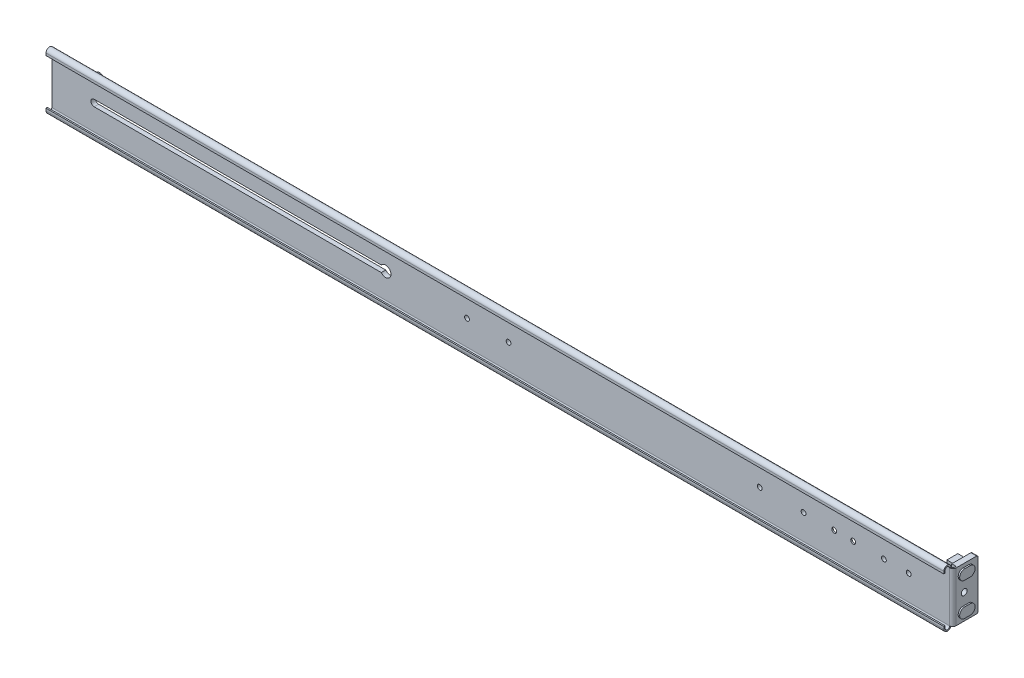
ISO-10303-21;
HEADER;
FILE_DESCRIPTION(('STEP AP214'),'2;1');
FILE_NAME('part.step','',(''),(''),'','','');
FILE_SCHEMA(('AUTOMOTIVE_DESIGN { 1 0 10303 214 1 1 1 1 }'));
ENDSEC;
DATA;
#1=APPLICATION_CONTEXT('core data for automotive mechanical design processes');
#2=APPLICATION_PROTOCOL_DEFINITION('international standard','automotive_design',2000,#1);
#3=PRODUCT_CONTEXT('',#1,'mechanical');
#4=PRODUCT('Part','Part','',(#3));
#5=PRODUCT_RELATED_PRODUCT_CATEGORY('part','',(#4));
#6=PRODUCT_DEFINITION_FORMATION('','',#4);
#7=PRODUCT_DEFINITION_CONTEXT('part definition',#1,'design');
#8=PRODUCT_DEFINITION('design','',#6,#7);
#9=PRODUCT_DEFINITION_SHAPE('','',#8);
#10=(LENGTH_UNIT() NAMED_UNIT(*) SI_UNIT(.MILLI.,.METRE.));
#11=(NAMED_UNIT(*) PLANE_ANGLE_UNIT() SI_UNIT($,.RADIAN.));
#12=(NAMED_UNIT(*) SI_UNIT($,.STERADIAN.) SOLID_ANGLE_UNIT());
#13=UNCERTAINTY_MEASURE_WITH_UNIT(LENGTH_MEASURE(1.E-05),#10,'distance_accuracy_value','');
#14=(GEOMETRIC_REPRESENTATION_CONTEXT(3) GLOBAL_UNCERTAINTY_ASSIGNED_CONTEXT((#13)) GLOBAL_UNIT_ASSIGNED_CONTEXT((#10,
#11,#12)) REPRESENTATION_CONTEXT('',''));
#15=CARTESIAN_POINT('',(0.,0.,0.));
#16=DIRECTION('',(0.,0.,1.));
#17=DIRECTION('',(1.,0.,0.));
#18=AXIS2_PLACEMENT_3D('',#15,#16,#17);
#19=CARTESIAN_POINT('',(309.59982,0.,1.04881944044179E-12));
#20=DIRECTION('',(-1.,0.,0.));
#21=DIRECTION('',(0.,0.,1.));
#22=AXIS2_PLACEMENT_3D('',#19,#20,#21);
#23=PLANE('',#22);
#24=CARTESIAN_POINT('',(309.59982,11.32036,-7.1));
#25=DIRECTION('',(1.,0.,0.));
#26=DIRECTION('',(0.,0.,-1.));
#27=AXIS2_PLACEMENT_3D('',#24,#25,#26);
#28=CIRCLE('',#27,3.4);
#29=CARTESIAN_POINT('',(309.59982,14.72036,-7.1));
#30=VERTEX_POINT('',#29);
#31=CARTESIAN_POINT('',(309.59982,7.92035999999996,-7.1));
#32=VERTEX_POINT('',#31);
#33=EDGE_CURVE('E445',#30,#32,#28,.T.);
#34=ORIENTED_EDGE('',*,*,#33,.F.);
#35=DIRECTION('',(0.,0.,1.));
#36=VECTOR('',#35,1.);
#37=CARTESIAN_POINT('',(309.59982,14.72036,1.17292651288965E-12));
#38=LINE('',#37,#36);
#39=CARTESIAN_POINT('',(309.59982,14.72036,-10.9));
#40=VERTEX_POINT('',#39);
#41=EDGE_CURVE('E461',#40,#30,#38,.T.);
#42=ORIENTED_EDGE('',*,*,#41,.F.);
#43=CARTESIAN_POINT('',(309.59982,11.32036,-10.9));
#44=DIRECTION('',(1.,0.,0.));
#45=DIRECTION('',(0.,0.,-1.));
#46=AXIS2_PLACEMENT_3D('',#43,#44,#45);
#47=CIRCLE('',#46,3.4);
#48=CARTESIAN_POINT('',(309.59982,7.92035999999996,-10.9));
#49=VERTEX_POINT('',#48);
#50=EDGE_CURVE('E474',#49,#40,#47,.T.);
#51=ORIENTED_EDGE('',*,*,#50,.F.);
#52=DIRECTION('',(0.,0.,1.));
#53=VECTOR('',#52,1.);
#54=CARTESIAN_POINT('',(309.59982,7.92035999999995,1.17654220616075E-12));
#55=LINE('',#54,#53);
#56=EDGE_CURVE('E88',#49,#32,#55,.T.);
#57=ORIENTED_EDGE('',*,*,#56,.T.);
#58=EDGE_LOOP('',(#34,#42,#51,#57));
#59=FACE_BOUND('',#58,.T.);
#60=CARTESIAN_POINT('',(309.59982,0.,-7.82036000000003));
#61=DIRECTION('',(-1.,0.,0.));
#62=DIRECTION('',(0.,0.,1.));
#63=AXIS2_PLACEMENT_3D('',#60,#61,#62);
#64=CIRCLE('',#63,2.0193);
#65=CARTESIAN_POINT('',(309.59982,0.,-5.80106000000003));
#66=VERTEX_POINT('',#65);
#67=EDGE_CURVE('E499',#66,#66,#64,.T.);
#68=ORIENTED_EDGE('',*,*,#67,.T.);
#69=EDGE_LOOP('',(#68));
#70=FACE_BOUND('',#69,.T.);
#71=DIRECTION('',(0.,1.,0.));
#72=VECTOR('',#71,1.);
#73=CARTESIAN_POINT('',(309.59982,0.,-17.25));
#74=LINE('',#73,#72);
#75=CARTESIAN_POINT('',(309.59982,-16.1703599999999,-17.25));
#76=VERTEX_POINT('',#75);
#77=CARTESIAN_POINT('',(309.59982,16.17036,-17.25));
#78=VERTEX_POINT('',#77);
#79=EDGE_CURVE('E949',#76,#78,#74,.T.);
#80=ORIENTED_EDGE('',*,*,#79,.T.);
#81=CARTESIAN_POINT('',(309.59982,16.17036,-16.25));
#82=DIRECTION('',(-1.,0.,0.));
#83=DIRECTION('',(0.,0.,1.));
#84=AXIS2_PLACEMENT_3D('',#81,#82,#83);
#85=CIRCLE('',#84,1.);
#86=CARTESIAN_POINT('',(309.59982,17.17036,-16.25));
#87=VERTEX_POINT('',#86);
#88=EDGE_CURVE('E73',#78,#87,#85,.F.);
#89=ORIENTED_EDGE('',*,*,#88,.T.);
#90=DIRECTION('',(0.,0.,1.));
#91=VECTOR('',#90,1.);
#92=CARTESIAN_POINT('',(309.59982,17.1703599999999,1.06342001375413E-12));
#93=LINE('',#92,#91);
#94=CARTESIAN_POINT('',(309.59982,17.1703599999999,-2.19964));
#95=VERTEX_POINT('',#94);
#96=EDGE_CURVE('E945',#87,#95,#93,.T.);
#97=ORIENTED_EDGE('',*,*,#96,.T.);
#98=DIRECTION('',(0.,-1.,0.));
#99=VECTOR('',#98,1.);
#100=CARTESIAN_POINT('',(309.59982,17.1703599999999,-2.19964));
#101=LINE('',#100,#99);
#102=CARTESIAN_POINT('',(309.59982,-17.17036,-2.19964));
#103=VERTEX_POINT('',#102);
#104=EDGE_CURVE('E963',#103,#95,#101,.F.);
#105=ORIENTED_EDGE('',*,*,#104,.F.);
#106=DIRECTION('',(0.,0.,-1.));
#107=VECTOR('',#106,1.);
#108=CARTESIAN_POINT('',(309.59982,-17.17036,1.03056872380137E-12));
#109=LINE('',#108,#107);
#110=CARTESIAN_POINT('',(309.59982,-17.1703599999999,-16.25));
#111=VERTEX_POINT('',#110);
#112=EDGE_CURVE('E952',#103,#111,#109,.T.);
#113=ORIENTED_EDGE('',*,*,#112,.T.);
#114=CARTESIAN_POINT('',(309.59982,-16.1703599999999,-16.25));
#115=DIRECTION('',(-1.,0.,0.));
#116=DIRECTION('',(0.,0.,1.));
#117=AXIS2_PLACEMENT_3D('',#114,#115,#116);
#118=CIRCLE('',#117,1.);
#119=EDGE_CURVE('E1191',#111,#76,#118,.F.);
#120=ORIENTED_EDGE('',*,*,#119,.T.);
#121=EDGE_LOOP('',(#80,#89,#97,#105,#113,#120));
#122=FACE_BOUND('',#121,.T.);
#123=CARTESIAN_POINT('',(309.59982,-11.3203599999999,-7.1));
#124=DIRECTION('',(1.,0.,0.));
#125=DIRECTION('',(0.,0.,-1.));
#126=AXIS2_PLACEMENT_3D('',#123,#124,#125);
#127=CIRCLE('',#126,3.4);
#128=CARTESIAN_POINT('',(309.59982,-7.92035999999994,-7.1));
#129=VERTEX_POINT('',#128);
#130=CARTESIAN_POINT('',(309.59982,-14.7203599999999,-7.1));
#131=VERTEX_POINT('',#130);
#132=EDGE_CURVE('E442',#129,#131,#127,.T.);
#133=ORIENTED_EDGE('',*,*,#132,.F.);
#134=DIRECTION('',(0.,0.,-1.));
#135=VECTOR('',#134,1.);
#136=CARTESIAN_POINT('',(309.59982,-7.92035999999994,1.17292651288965E-12));
#137=LINE('',#136,#135);
#138=CARTESIAN_POINT('',(309.59982,-7.92035999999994,-10.9));
#139=VERTEX_POINT('',#138);
#140=EDGE_CURVE('E438',#129,#139,#137,.T.);
#141=ORIENTED_EDGE('',*,*,#140,.T.);
#142=CARTESIAN_POINT('',(309.59982,-11.3203599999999,-10.9));
#143=DIRECTION('',(1.,0.,0.));
#144=DIRECTION('',(0.,0.,-1.));
#145=AXIS2_PLACEMENT_3D('',#142,#143,#144);
#146=CIRCLE('',#145,3.4);
#147=CARTESIAN_POINT('',(309.59982,-14.7203599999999,-10.9));
#148=VERTEX_POINT('',#147);
#149=EDGE_CURVE('E80',#148,#139,#146,.T.);
#150=ORIENTED_EDGE('',*,*,#149,.F.);
#151=DIRECTION('',(0.,0.,-1.));
#152=VECTOR('',#151,1.);
#153=CARTESIAN_POINT('',(309.59982,-14.7203599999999,1.17292651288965E-12));
#154=LINE('',#153,#152);
#155=EDGE_CURVE('E2582',#131,#148,#154,.T.);
#156=ORIENTED_EDGE('',*,*,#155,.F.);
#157=EDGE_LOOP('',(#133,#141,#150,#156));
#158=FACE_BOUND('',#157,.T.);
#159=ADVANCED_FACE('F64',(#59,#70,#122,#158),#23,.F.);
#160=CARTESIAN_POINT('',(305.67018,-16.1703599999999,-16.25));
#161=DIRECTION('',(1.,0.,0.));
#162=DIRECTION('',(0.,0.,-1.));
#163=AXIS2_PLACEMENT_3D('',#160,#161,#162);
#164=PLANE('',#163);
#165=CARTESIAN_POINT('',(305.67018,0.,-7.82036000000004));
#166=DIRECTION('',(-1.,0.,0.));
#167=DIRECTION('',(0.,0.,1.));
#168=AXIS2_PLACEMENT_3D('',#165,#166,#167);
#169=CIRCLE('',#168,2.0193);
#170=CARTESIAN_POINT('',(305.67018,0.,-5.80106000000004));
#171=VERTEX_POINT('',#170);
#172=EDGE_CURVE('E495',#171,#171,#169,.T.);
#173=ORIENTED_EDGE('',*,*,#172,.F.);
#174=EDGE_LOOP('',(#173));
#175=FACE_BOUND('',#174,.T.);
#176=DIRECTION('',(0.,-1.,0.));
#177=VECTOR('',#176,1.);
#178=CARTESIAN_POINT('',(305.67018,15.72036,-12.75));
#179=LINE('',#178,#177);
#180=CARTESIAN_POINT('',(305.67018,15.72036,-12.75));
#181=VERTEX_POINT('',#180);
#182=CARTESIAN_POINT('',(305.67018,6.92035999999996,-12.75));
#183=VERTEX_POINT('',#182);
#184=EDGE_CURVE('E548',#181,#183,#179,.T.);
#185=ORIENTED_EDGE('',*,*,#184,.F.);
#186=DIRECTION('',(0.,0.,-1.));
#187=VECTOR('',#186,1.);
#188=CARTESIAN_POINT('',(305.67018,15.72036,-12.75));
#189=LINE('',#188,#187);
#190=CARTESIAN_POINT('',(305.67018,15.72036,-5.25000000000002));
#191=VERTEX_POINT('',#190);
#192=EDGE_CURVE('E554',#191,#181,#189,.T.);
#193=ORIENTED_EDGE('',*,*,#192,.F.);
#194=DIRECTION('',(0.,1.,0.));
#195=VECTOR('',#194,1.);
#196=CARTESIAN_POINT('',(305.67018,15.72036,-5.25000000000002));
#197=LINE('',#196,#195);
#198=CARTESIAN_POINT('',(305.67018,6.92035999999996,-5.25000000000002));
#199=VERTEX_POINT('',#198);
#200=EDGE_CURVE('E571',#199,#191,#197,.T.);
#201=ORIENTED_EDGE('',*,*,#200,.F.);
#202=DIRECTION('',(0.,0.,1.));
#203=VECTOR('',#202,1.);
#204=CARTESIAN_POINT('',(305.67018,6.92035999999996,-12.75));
#205=LINE('',#204,#203);
#206=EDGE_CURVE('E567',#183,#199,#205,.T.);
#207=ORIENTED_EDGE('',*,*,#206,.F.);
#208=EDGE_LOOP('',(#185,#193,#201,#207));
#209=FACE_BOUND('',#208,.T.);
#210=DIRECTION('',(0.,1.,0.));
#211=VECTOR('',#210,1.);
#212=CARTESIAN_POINT('',(305.67018,17.17036,-3.19964000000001));
#213=LINE('',#212,#211);
#214=CARTESIAN_POINT('',(305.67018,-17.1703599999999,-3.19964000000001));
#215=VERTEX_POINT('',#214);
#216=CARTESIAN_POINT('',(305.67018,17.17036,-3.19964000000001));
#217=VERTEX_POINT('',#216);
#218=EDGE_CURVE('E594',#215,#217,#213,.T.);
#219=ORIENTED_EDGE('',*,*,#218,.T.);
#220=DIRECTION('',(0.,0.,-1.));
#221=VECTOR('',#220,1.);
#222=CARTESIAN_POINT('',(305.67018,17.17036,-3.19964000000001));
#223=LINE('',#222,#221);
#224=CARTESIAN_POINT('',(305.67018,17.17036,-16.25));
#225=VERTEX_POINT('',#224);
#226=EDGE_CURVE('E598',#217,#225,#223,.T.);
#227=ORIENTED_EDGE('',*,*,#226,.T.);
#228=CARTESIAN_POINT('',(305.67018,16.17036,-16.25));
#229=DIRECTION('',(-1.,0.,0.));
#230=DIRECTION('',(0.,0.,1.));
#231=AXIS2_PLACEMENT_3D('',#228,#229,#230);
#232=CIRCLE('',#231,1.);
#233=CARTESIAN_POINT('',(305.67018,16.1703599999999,-17.25));
#234=VERTEX_POINT('',#233);
#235=EDGE_CURVE('E602',#225,#234,#232,.T.);
#236=ORIENTED_EDGE('',*,*,#235,.T.);
#237=DIRECTION('',(0.,-1.,0.));
#238=VECTOR('',#237,1.);
#239=CARTESIAN_POINT('',(305.67018,16.1703599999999,-17.25));
#240=LINE('',#239,#238);
#241=CARTESIAN_POINT('',(305.67018,-16.1703599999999,-17.25));
#242=VERTEX_POINT('',#241);
#243=EDGE_CURVE('E606',#234,#242,#240,.T.);
#244=ORIENTED_EDGE('',*,*,#243,.T.);
#245=CARTESIAN_POINT('',(305.67018,-16.1703599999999,-16.25));
#246=DIRECTION('',(-1.,0.,0.));
#247=DIRECTION('',(0.,0.,-1.));
#248=AXIS2_PLACEMENT_3D('',#245,#246,#247);
#249=CIRCLE('',#248,1.);
#250=CARTESIAN_POINT('',(305.67018,-17.1703599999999,-16.25));
#251=VERTEX_POINT('',#250);
#252=EDGE_CURVE('E610',#242,#251,#249,.T.);
#253=ORIENTED_EDGE('',*,*,#252,.T.);
#254=DIRECTION('',(0.,0.,1.));
#255=VECTOR('',#254,1.);
#256=CARTESIAN_POINT('',(305.67018,-17.1703599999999,-3.19964000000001));
#257=LINE('',#256,#255);
#258=EDGE_CURVE('E614',#251,#215,#257,.T.);
#259=ORIENTED_EDGE('',*,*,#258,.T.);
#260=EDGE_LOOP('',(#219,#227,#236,#244,#253,#259));
#261=FACE_BOUND('',#260,.T.);
#262=DIRECTION('',(0.,-1.,0.));
#263=VECTOR('',#262,1.);
#264=CARTESIAN_POINT('',(305.67018,-6.92035999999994,-12.75));
#265=LINE('',#264,#263);
#266=CARTESIAN_POINT('',(305.67018,-6.92035999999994,-12.75));
#267=VERTEX_POINT('',#266);
#268=CARTESIAN_POINT('',(305.67018,-15.7203599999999,-12.75));
#269=VERTEX_POINT('',#268);
#270=EDGE_CURVE('E503',#267,#269,#265,.T.);
#271=ORIENTED_EDGE('',*,*,#270,.F.);
#272=DIRECTION('',(0.,0.,-1.));
#273=VECTOR('',#272,1.);
#274=CARTESIAN_POINT('',(305.67018,-6.92035999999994,-12.75));
#275=LINE('',#274,#273);
#276=CARTESIAN_POINT('',(305.67018,-6.92035999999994,-5.25000000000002));
#277=VERTEX_POINT('',#276);
#278=EDGE_CURVE('E509',#277,#267,#275,.T.);
#279=ORIENTED_EDGE('',*,*,#278,.F.);
#280=DIRECTION('',(0.,1.,0.));
#281=VECTOR('',#280,1.);
#282=CARTESIAN_POINT('',(305.67018,-6.92035999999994,-5.25000000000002));
#283=LINE('',#282,#281);
#284=CARTESIAN_POINT('',(305.67018,-15.7203599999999,-5.25000000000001));
#285=VERTEX_POINT('',#284);
#286=EDGE_CURVE('E526',#285,#277,#283,.T.);
#287=ORIENTED_EDGE('',*,*,#286,.F.);
#288=DIRECTION('',(0.,0.,1.));
#289=VECTOR('',#288,1.);
#290=CARTESIAN_POINT('',(305.67018,-15.7203599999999,-12.75));
#291=LINE('',#290,#289);
#292=EDGE_CURVE('E522',#269,#285,#291,.T.);
#293=ORIENTED_EDGE('',*,*,#292,.F.);
#294=EDGE_LOOP('',(#271,#279,#287,#293));
#295=FACE_BOUND('',#294,.T.);
#296=ADVANCED_FACE('F1210',(#175,#209,#261,#295),#164,.F.);
#297=CARTESIAN_POINT('',(308.67018,0.,1.04557361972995E-12));
#298=DIRECTION('',(-1.,0.,0.));
#299=DIRECTION('',(0.,0.,1.));
#300=AXIS2_PLACEMENT_3D('',#297,#298,#299);
#301=PLANE('',#300);
#302=DIRECTION('',(0.,0.,-1.));
#303=VECTOR('',#302,1.);
#304=CARTESIAN_POINT('',(308.67018,17.1703599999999,-0.92964));
#305=LINE('',#304,#303);
#306=CARTESIAN_POINT('',(308.67018,17.1703599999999,-3.19964));
#307=VERTEX_POINT('',#306);
#308=CARTESIAN_POINT('',(308.67018,17.1703599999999,-2.19964));
#309=VERTEX_POINT('',#308);
#310=EDGE_CURVE('E956',#307,#309,#305,.F.);
#311=ORIENTED_EDGE('',*,*,#310,.F.);
#312=DIRECTION('',(0.,1.,0.));
#313=VECTOR('',#312,1.);
#314=CARTESIAN_POINT('',(308.67018,17.17036,-3.19964));
#315=LINE('',#314,#313);
#316=CARTESIAN_POINT('',(308.67018,-17.17036,-3.19964));
#317=VERTEX_POINT('',#316);
#318=EDGE_CURVE('E593',#317,#307,#315,.T.);
#319=ORIENTED_EDGE('',*,*,#318,.F.);
#320=DIRECTION('',(0.,0.,1.));
#321=VECTOR('',#320,1.);
#322=CARTESIAN_POINT('',(308.67018,-17.1703599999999,-17.25));
#323=LINE('',#322,#321);
#324=CARTESIAN_POINT('',(308.67018,-17.17036,-2.19964));
#325=VERTEX_POINT('',#324);
#326=EDGE_CURVE('E959',#325,#317,#323,.F.);
#327=ORIENTED_EDGE('',*,*,#326,.F.);
#328=DIRECTION('',(0.,-1.,0.));
#329=VECTOR('',#328,1.);
#330=CARTESIAN_POINT('',(308.67018,17.1703599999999,-2.19964));
#331=LINE('',#330,#329);
#332=EDGE_CURVE('E971',#309,#325,#331,.T.);
#333=ORIENTED_EDGE('',*,*,#332,.F.);
#334=EDGE_LOOP('',(#311,#319,#327,#333));
#335=FACE_BOUND('',#334,.T.);
#336=ADVANCED_FACE('F1239',(#335),#301,.T.);
#337=CARTESIAN_POINT('',(0.,0.,-0.92964));
#338=DIRECTION('',(0.,0.,-1.));
#339=DIRECTION('',(-1.,0.,0.));
#340=AXIS2_PLACEMENT_3D('',#337,#338,#339);
#341=PLANE('',#340);
#342=CARTESIAN_POINT('',(241.39982,0.,-0.92964));
#343=DIRECTION('',(0.,0.,-1.));
#344=DIRECTION('',(-1.,0.,0.));
#345=AXIS2_PLACEMENT_3D('',#342,#343,#344);
#346=CIRCLE('',#345,1.70000000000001);
#347=CARTESIAN_POINT('',(239.69982,0.,-0.92964));
#348=VERTEX_POINT('',#347);
#349=EDGE_CURVE('E629',#348,#348,#346,.T.);
#350=ORIENTED_EDGE('',*,*,#349,.F.);
#351=EDGE_LOOP('',(#350));
#352=FACE_BOUND('',#351,.T.);
#353=CARTESIAN_POINT('',(228.39982,0.,-0.92964));
#354=DIRECTION('',(0.,0.,-1.));
#355=DIRECTION('',(-1.,0.,0.));
#356=AXIS2_PLACEMENT_3D('',#353,#354,#355);
#357=CIRCLE('',#356,1.70000000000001);
#358=CARTESIAN_POINT('',(226.69982,0.,-0.92964));
#359=VERTEX_POINT('',#358);
#360=EDGE_CURVE('E628',#359,#359,#357,.T.);
#361=ORIENTED_EDGE('',*,*,#360,.F.);
#362=EDGE_LOOP('',(#361));
#363=FACE_BOUND('',#362,.T.);
#364=CARTESIAN_POINT('',(279.39982,0.,-0.92964));
#365=DIRECTION('',(0.,0.,-1.));
#366=DIRECTION('',(-1.,0.,0.));
#367=AXIS2_PLACEMENT_3D('',#364,#365,#366);
#368=CIRCLE('',#367,7.50000000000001);
#369=CARTESIAN_POINT('',(271.89982,0.,-0.92964));
#370=VERTEX_POINT('',#369);
#371=EDGE_CURVE('E653',#370,#370,#368,.T.);
#372=ORIENTED_EDGE('',*,*,#371,.F.);
#373=EDGE_LOOP('',(#372));
#374=FACE_BOUND('',#373,.T.);
#375=CARTESIAN_POINT('',(262.39982,0.,-0.92964));
#376=DIRECTION('',(0.,0.,-1.));
#377=DIRECTION('',(-1.,0.,0.));
#378=AXIS2_PLACEMENT_3D('',#375,#376,#377);
#379=CIRCLE('',#378,7.50000000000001);
#380=CARTESIAN_POINT('',(254.89982,0.,-0.92964));
#381=VERTEX_POINT('',#380);
#382=EDGE_CURVE('E661',#381,#381,#379,.T.);
#383=ORIENTED_EDGE('',*,*,#382,.F.);
#384=EDGE_LOOP('',(#383));
#385=FACE_BOUND('',#384,.T.);
#386=CARTESIAN_POINT('',(207.39982,0.,-0.92964));
#387=DIRECTION('',(0.,0.,-1.));
#388=DIRECTION('',(-1.,0.,0.));
#389=AXIS2_PLACEMENT_3D('',#386,#387,#388);
#390=CIRCLE('',#389,7.50000000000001);
#391=CARTESIAN_POINT('',(199.89982,0.,-0.92964));
#392=VERTEX_POINT('',#391);
#393=EDGE_CURVE('E669',#392,#392,#390,.T.);
#394=ORIENTED_EDGE('',*,*,#393,.F.);
#395=EDGE_LOOP('',(#394));
#396=FACE_BOUND('',#395,.T.);
#397=CARTESIAN_POINT('',(177.39982,0.,-0.92964));
#398=DIRECTION('',(0.,0.,-1.));
#399=DIRECTION('',(-1.,0.,0.));
#400=AXIS2_PLACEMENT_3D('',#397,#398,#399);
#401=CIRCLE('',#400,7.75);
#402=CARTESIAN_POINT('',(169.64982,0.,-0.92964));
#403=VERTEX_POINT('',#402);
#404=EDGE_CURVE('E695',#403,#403,#401,.T.);
#405=ORIENTED_EDGE('',*,*,#404,.F.);
#406=EDGE_LOOP('',(#405));
#407=FACE_BOUND('',#406,.T.);
#408=CARTESIAN_POINT('',(-278.40018,-13.05,-0.92964));
#409=DIRECTION('',(0.,0.,-1.));
#410=DIRECTION('',(-1.,0.,0.));
#411=AXIS2_PLACEMENT_3D('',#408,#409,#410);
#412=CIRCLE('',#411,1.95000000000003);
#413=CARTESIAN_POINT('',(-280.35018,-13.05,-0.92964));
#414=VERTEX_POINT('',#413);
#415=EDGE_CURVE('E756',#414,#414,#412,.T.);
#416=ORIENTED_EDGE('',*,*,#415,.F.);
#417=EDGE_LOOP('',(#416));
#418=FACE_BOUND('',#417,.T.);
#419=CARTESIAN_POINT('',(-278.40018,13.05,-0.92964));
#420=DIRECTION('',(0.,0.,-1.));
#421=DIRECTION('',(-1.,0.,0.));
#422=AXIS2_PLACEMENT_3D('',#419,#420,#421);
#423=CIRCLE('',#422,1.95000000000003);
#424=CARTESIAN_POINT('',(-280.35018,13.05,-0.92964));
#425=VERTEX_POINT('',#424);
#426=EDGE_CURVE('E764',#425,#425,#423,.T.);
#427=ORIENTED_EDGE('',*,*,#426,.F.);
#428=EDGE_LOOP('',(#427));
#429=FACE_BOUND('',#428,.T.);
#430=DIRECTION('',(0.,-1.,0.));
#431=VECTOR('',#430,1.);
#432=CARTESIAN_POINT('',(-45.1501800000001,16.1703599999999,-0.92964));
#433=LINE('',#432,#431);
#434=CARTESIAN_POINT('',(-45.1501800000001,16.1703599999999,-0.92964));
#435=VERTEX_POINT('',#434);
#436=CARTESIAN_POINT('',(-45.1501800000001,6.17035999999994,-0.92964));
#437=VERTEX_POINT('',#436);
#438=EDGE_CURVE('E875',#435,#437,#433,.T.);
#439=ORIENTED_EDGE('',*,*,#438,.F.);
#440=DIRECTION('',(1.,0.,0.));
#441=VECTOR('',#440,1.);
#442=CARTESIAN_POINT('',(-45.1501800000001,16.1703599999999,-0.92964));
#443=LINE('',#442,#441);
#444=CARTESIAN_POINT('',(-45.65018,16.1703599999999,-0.92964));
#445=VERTEX_POINT('',#444);
#446=EDGE_CURVE('E862',#445,#435,#443,.T.);
#447=ORIENTED_EDGE('',*,*,#446,.F.);
#448=DIRECTION('',(0.,1.,0.));
#449=VECTOR('',#448,1.);
#450=CARTESIAN_POINT('',(-45.65018,16.1703599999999,-0.92964));
#451=LINE('',#450,#449);
#452=CARTESIAN_POINT('',(-45.65018,6.17035999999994,-0.92964));
#453=VERTEX_POINT('',#452);
#454=EDGE_CURVE('E883',#453,#445,#451,.T.);
#455=ORIENTED_EDGE('',*,*,#454,.F.);
#456=DIRECTION('',(-1.,0.,0.));
#457=VECTOR('',#456,1.);
#458=CARTESIAN_POINT('',(-45.1501800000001,6.17035999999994,-0.92964));
#459=LINE('',#458,#457);
#460=EDGE_CURVE('E878',#437,#453,#459,.T.);
#461=ORIENTED_EDGE('',*,*,#460,.F.);
#462=EDGE_LOOP('',(#439,#447,#455,#461));
#463=FACE_BOUND('',#462,.T.);
#464=DIRECTION('',(0.,-1.,0.));
#465=VECTOR('',#464,1.);
#466=CARTESIAN_POINT('',(-45.15018,-6.17035999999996,-0.92964));
#467=LINE('',#466,#465);
#468=CARTESIAN_POINT('',(-45.15018,-6.17035999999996,-0.92964));
#469=VERTEX_POINT('',#468);
#470=CARTESIAN_POINT('',(-45.15018,-16.17036,-0.92964));
#471=VERTEX_POINT('',#470);
#472=EDGE_CURVE('E856',#469,#471,#467,.T.);
#473=ORIENTED_EDGE('',*,*,#472,.F.);
#474=DIRECTION('',(1.,0.,0.));
#475=VECTOR('',#474,1.);
#476=CARTESIAN_POINT('',(-45.15018,-6.17035999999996,-0.92964));
#477=LINE('',#476,#475);
#478=CARTESIAN_POINT('',(-45.65018,-6.17035999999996,-0.92964));
#479=VERTEX_POINT('',#478);
#480=EDGE_CURVE('E908',#479,#469,#477,.T.);
#481=ORIENTED_EDGE('',*,*,#480,.F.);
#482=DIRECTION('',(0.,1.,0.));
#483=VECTOR('',#482,1.);
#484=CARTESIAN_POINT('',(-45.65018,-6.17035999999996,-0.92964));
#485=LINE('',#484,#483);
#486=CARTESIAN_POINT('',(-45.65018,-16.17036,-0.92964));
#487=VERTEX_POINT('',#486);
#488=EDGE_CURVE('E927',#487,#479,#485,.T.);
#489=ORIENTED_EDGE('',*,*,#488,.F.);
#490=DIRECTION('',(-1.,0.,0.));
#491=VECTOR('',#490,1.);
#492=CARTESIAN_POINT('',(-45.15018,-16.17036,-0.92964));
#493=LINE('',#492,#491);
#494=EDGE_CURVE('E923',#471,#487,#493,.T.);
#495=ORIENTED_EDGE('',*,*,#494,.F.);
#496=EDGE_LOOP('',(#473,#481,#489,#495));
#497=FACE_BOUND('',#496,.T.);
#498=DIRECTION('',(-1.,0.,0.));
#499=VECTOR('',#498,1.);
#500=CARTESIAN_POINT('',(-307.40018,17.1703599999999,-0.92964));
#501=LINE('',#500,#499);
#502=CARTESIAN_POINT('',(-307.40018,17.1703599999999,-0.92964));
#503=VERTEX_POINT('',#502);
#504=CARTESIAN_POINT('',(307.40018,17.1703599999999,-0.929640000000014));
#505=VERTEX_POINT('',#504);
#506=EDGE_CURVE('E993',#503,#505,#501,.F.);
#507=ORIENTED_EDGE('',*,*,#506,.T.);
#508=DIRECTION('',(0.,1.,0.));
#509=VECTOR('',#508,1.);
#510=CARTESIAN_POINT('',(307.40018,19.625,-0.92964));
#511=LINE('',#510,#509);
#512=CARTESIAN_POINT('',(307.40018,-17.17036,-0.929640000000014));
#513=VERTEX_POINT('',#512);
#514=EDGE_CURVE('E1148',#513,#505,#511,.T.);
#515=ORIENTED_EDGE('',*,*,#514,.F.);
#516=DIRECTION('',(1.,0.,0.));
#517=VECTOR('',#516,1.);
#518=CARTESIAN_POINT('',(307.40018,-17.17036,-0.92964));
#519=LINE('',#518,#517);
#520=CARTESIAN_POINT('',(-307.40018,-17.17036,-0.92964));
#521=VERTEX_POINT('',#520);
#522=EDGE_CURVE('E1069',#513,#521,#519,.F.);
#523=ORIENTED_EDGE('',*,*,#522,.T.);
#524=DIRECTION('',(0.,-1.,0.));
#525=VECTOR('',#524,1.);
#526=CARTESIAN_POINT('',(-307.40018,19.625,-0.92964));
#527=LINE('',#526,#525);
#528=EDGE_CURVE('E1145',#503,#521,#527,.T.);
#529=ORIENTED_EDGE('',*,*,#528,.F.);
#530=EDGE_LOOP('',(#507,#515,#523,#529));
#531=FACE_BOUND('',#530,.T.);
#532=DIRECTION('',(-1.,0.,0.));
#533=VECTOR('',#532,1.);
#534=CARTESIAN_POINT('',(-78.8001800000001,-7.2,-0.92964));
#535=LINE('',#534,#533);
#536=CARTESIAN_POINT('',(-78.8001800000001,-7.2,-0.92964));
#537=VERTEX_POINT('',#536);
#538=CARTESIAN_POINT('',(-278.40018,-7.2,-0.92964));
#539=VERTEX_POINT('',#538);
#540=EDGE_CURVE('E834',#537,#539,#535,.T.);
#541=ORIENTED_EDGE('',*,*,#540,.F.);
#542=CARTESIAN_POINT('',(-78.8001800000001,0.,-0.92964));
#543=DIRECTION('',(0.,0.,-1.));
#544=DIRECTION('',(-1.,0.,0.));
#545=AXIS2_PLACEMENT_3D('',#542,#543,#544);
#546=CIRCLE('',#545,7.2);
#547=CARTESIAN_POINT('',(-78.8001800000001,7.2,-0.92964));
#548=VERTEX_POINT('',#547);
#549=EDGE_CURVE('E815',#548,#537,#546,.T.);
#550=ORIENTED_EDGE('',*,*,#549,.F.);
#551=DIRECTION('',(1.,0.,0.));
#552=VECTOR('',#551,1.);
#553=CARTESIAN_POINT('',(-78.8001800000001,7.2,-0.92964));
#554=LINE('',#553,#552);
#555=CARTESIAN_POINT('',(-278.40018,7.2,-0.92964));
#556=VERTEX_POINT('',#555);
#557=EDGE_CURVE('E821',#556,#548,#554,.T.);
#558=ORIENTED_EDGE('',*,*,#557,.F.);
#559=CARTESIAN_POINT('',(-278.40018,0.,-0.92964));
#560=DIRECTION('',(0.,0.,-1.));
#561=DIRECTION('',(-1.,0.,0.));
#562=AXIS2_PLACEMENT_3D('',#559,#560,#561);
#563=CIRCLE('',#562,7.2);
#564=EDGE_CURVE('E837',#539,#556,#563,.T.);
#565=ORIENTED_EDGE('',*,*,#564,.F.);
#566=EDGE_LOOP('',(#541,#550,#558,#565));
#567=FACE_BOUND('',#566,.T.);
#568=DIRECTION('',(-1.,0.,0.));
#569=VECTOR('',#568,1.);
#570=CARTESIAN_POINT('',(5.39981999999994,-8.5,-0.92964));
#571=LINE('',#570,#569);
#572=CARTESIAN_POINT('',(5.39981999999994,-8.5,-0.92964));
#573=VERTEX_POINT('',#572);
#574=CARTESIAN_POINT('',(-23.1001800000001,-8.5,-0.92964));
#575=VERTEX_POINT('',#574);
#576=EDGE_CURVE('E707',#573,#575,#571,.T.);
#577=ORIENTED_EDGE('',*,*,#576,.F.);
#578=CARTESIAN_POINT('',(5.39981999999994,0.,-0.92964));
#579=DIRECTION('',(0.,0.,-1.));
#580=DIRECTION('',(-1.,0.,0.));
#581=AXIS2_PLACEMENT_3D('',#578,#579,#580);
#582=CIRCLE('',#581,8.5);
#583=CARTESIAN_POINT('',(5.39981999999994,8.5,-0.92964));
#584=VERTEX_POINT('',#583);
#585=EDGE_CURVE('E703',#584,#573,#582,.T.);
#586=ORIENTED_EDGE('',*,*,#585,.F.);
#587=DIRECTION('',(1.,0.,0.));
#588=VECTOR('',#587,1.);
#589=CARTESIAN_POINT('',(5.39981999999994,8.5,-0.92964));
#590=LINE('',#589,#588);
#591=CARTESIAN_POINT('',(-23.1001800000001,8.5,-0.92964));
#592=VERTEX_POINT('',#591);
#593=EDGE_CURVE('E714',#592,#584,#590,.T.);
#594=ORIENTED_EDGE('',*,*,#593,.F.);
#595=CARTESIAN_POINT('',(-23.1001800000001,0.,-0.92964));
#596=DIRECTION('',(0.,0.,-1.));
#597=DIRECTION('',(-1.,0.,0.));
#598=AXIS2_PLACEMENT_3D('',#595,#596,#597);
#599=CIRCLE('',#598,8.5);
#600=EDGE_CURVE('E710',#575,#592,#599,.T.);
#601=ORIENTED_EDGE('',*,*,#600,.F.);
#602=EDGE_LOOP('',(#577,#586,#594,#601));
#603=FACE_BOUND('',#602,.T.);
#604=ADVANCED_FACE('F1241',(#352,#363,#374,#385,#396,#407,#418,#429,#463,#497,#531,#567,#603),
#341,.T.);
#605=CARTESIAN_POINT('',(-307.40018,19.625,-0.92964));
#606=DIRECTION('',(-1.,0.,0.));
#607=DIRECTION('',(0.,0.,1.));
#608=AXIS2_PLACEMENT_3D('',#605,#606,#607);
#609=PLANE('',#608);
#610=DIRECTION('',(0.,-1.,0.));
#611=VECTOR('',#610,1.);
#612=CARTESIAN_POINT('',(-307.40018,19.625,0.));
#613=LINE('',#612,#611);
#614=CARTESIAN_POINT('',(-307.40018,17.17036,0.));
#615=VERTEX_POINT('',#614);
#616=CARTESIAN_POINT('',(-307.40018,-17.17036,0.));
#617=VERTEX_POINT('',#616);
#618=EDGE_CURVE('E1142',#615,#617,#613,.T.);
#619=ORIENTED_EDGE('',*,*,#618,.F.);
#620=DIRECTION('',(0.,0.,-1.));
#621=VECTOR('',#620,1.);
#622=CARTESIAN_POINT('',(-307.40018,17.17036,0.));
#623=LINE('',#622,#621);
#624=EDGE_CURVE('E1002',#615,#503,#623,.T.);
#625=ORIENTED_EDGE('',*,*,#624,.T.);
#626=ORIENTED_EDGE('',*,*,#528,.T.);
#627=DIRECTION('',(0.,0.,-1.));
#628=VECTOR('',#627,1.);
#629=CARTESIAN_POINT('',(-307.40018,-17.17036,0.));
#630=LINE('',#629,#628);
#631=EDGE_CURVE('E1093',#617,#521,#630,.T.);
#632=ORIENTED_EDGE('',*,*,#631,.F.);
#633=EDGE_LOOP('',(#619,#625,#626,#632));
#634=FACE_BOUND('',#633,.T.);
#635=ADVANCED_FACE('F1247',(#634),#609,.T.);
#636=CARTESIAN_POINT('',(0.,0.,0.));
#637=DIRECTION('',(0.,0.,-1.));
#638=DIRECTION('',(-1.,0.,0.));
#639=AXIS2_PLACEMENT_3D('',#636,#637,#638);
#640=PLANE('',#639);
#641=CARTESIAN_POINT('',(241.39982,0.,0.));
#642=DIRECTION('',(0.,0.,-1.));
#643=DIRECTION('',(-1.,0.,0.));
#644=AXIS2_PLACEMENT_3D('',#641,#642,#643);
#645=CIRCLE('',#644,1.70000000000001);
#646=CARTESIAN_POINT('',(239.69982,0.,0.));
#647=VERTEX_POINT('',#646);
#648=EDGE_CURVE('E642',#647,#647,#645,.T.);
#649=ORIENTED_EDGE('',*,*,#648,.T.);
#650=EDGE_LOOP('',(#649));
#651=FACE_BOUND('',#650,.T.);
#652=CARTESIAN_POINT('',(228.39982,0.,0.));
#653=DIRECTION('',(0.,0.,-1.));
#654=DIRECTION('',(-1.,0.,0.));
#655=AXIS2_PLACEMENT_3D('',#652,#653,#654);
#656=CIRCLE('',#655,1.70000000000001);
#657=CARTESIAN_POINT('',(226.69982,0.,0.));
#658=VERTEX_POINT('',#657);
#659=EDGE_CURVE('E633',#658,#658,#656,.T.);
#660=ORIENTED_EDGE('',*,*,#659,.T.);
#661=EDGE_LOOP('',(#660));
#662=FACE_BOUND('',#661,.T.);
#663=CARTESIAN_POINT('',(207.39982,0.,0.));
#664=DIRECTION('',(0.,0.,-1.));
#665=DIRECTION('',(-1.,0.,0.));
#666=AXIS2_PLACEMENT_3D('',#663,#664,#665);
#667=CIRCLE('',#666,1.64999999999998);
#668=CARTESIAN_POINT('',(205.74982,0.,0.));
#669=VERTEX_POINT('',#668);
#670=EDGE_CURVE('E641',#669,#669,#667,.T.);
#671=ORIENTED_EDGE('',*,*,#670,.T.);
#672=EDGE_LOOP('',(#671));
#673=FACE_BOUND('',#672,.T.);
#674=CARTESIAN_POINT('',(279.39982,0.,0.));
#675=DIRECTION('',(0.,0.,-1.));
#676=DIRECTION('',(-1.,0.,0.));
#677=AXIS2_PLACEMENT_3D('',#674,#675,#676);
#678=CIRCLE('',#677,1.64999999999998);
#679=CARTESIAN_POINT('',(277.74982,0.,0.));
#680=VERTEX_POINT('',#679);
#681=EDGE_CURVE('E647',#680,#680,#678,.T.);
#682=ORIENTED_EDGE('',*,*,#681,.T.);
#683=EDGE_LOOP('',(#682));
#684=FACE_BOUND('',#683,.T.);
#685=CARTESIAN_POINT('',(262.39982,0.,0.));
#686=DIRECTION('',(0.,0.,-1.));
#687=DIRECTION('',(-1.,0.,0.));
#688=AXIS2_PLACEMENT_3D('',#685,#686,#687);
#689=CIRCLE('',#688,1.64999999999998);
#690=CARTESIAN_POINT('',(260.74982,0.,0.));
#691=VERTEX_POINT('',#690);
#692=EDGE_CURVE('E652',#691,#691,#689,.T.);
#693=ORIENTED_EDGE('',*,*,#692,.T.);
#694=EDGE_LOOP('',(#693));
#695=FACE_BOUND('',#694,.T.);
#696=CARTESIAN_POINT('',(177.39982,0.,0.));
#697=DIRECTION('',(0.,0.,-1.));
#698=DIRECTION('',(-1.,0.,0.));
#699=AXIS2_PLACEMENT_3D('',#696,#697,#698);
#700=CIRCLE('',#699,1.64999999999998);
#701=CARTESIAN_POINT('',(175.74982,0.,0.));
#702=VERTEX_POINT('',#701);
#703=EDGE_CURVE('E681',#702,#702,#700,.T.);
#704=ORIENTED_EDGE('',*,*,#703,.T.);
#705=EDGE_LOOP('',(#704));
#706=FACE_BOUND('',#705,.T.);
#707=CARTESIAN_POINT('',(5.39981999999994,0.,0.));
#708=DIRECTION('',(0.,0.,-1.));
#709=DIRECTION('',(-1.,0.,0.));
#710=AXIS2_PLACEMENT_3D('',#707,#708,#709);
#711=CIRCLE('',#710,1.64999999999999);
#712=CARTESIAN_POINT('',(3.74981999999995,0.,0.));
#713=VERTEX_POINT('',#712);
#714=EDGE_CURVE('E686',#713,#713,#711,.T.);
#715=ORIENTED_EDGE('',*,*,#714,.T.);
#716=EDGE_LOOP('',(#715));
#717=FACE_BOUND('',#716,.T.);
#718=CARTESIAN_POINT('',(-23.1001800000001,0.,0.));
#719=DIRECTION('',(0.,0.,-1.));
#720=DIRECTION('',(-1.,0.,0.));
#721=AXIS2_PLACEMENT_3D('',#718,#719,#720);
#722=CIRCLE('',#721,1.64999999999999);
#723=CARTESIAN_POINT('',(-24.75018,0.,0.));
#724=VERTEX_POINT('',#723);
#725=EDGE_CURVE('E691',#724,#724,#722,.T.);
#726=ORIENTED_EDGE('',*,*,#725,.T.);
#727=EDGE_LOOP('',(#726));
#728=FACE_BOUND('',#727,.T.);
#729=DIRECTION('',(1.,0.,0.));
#730=VECTOR('',#729,1.);
#731=CARTESIAN_POINT('',(0.,2.23,0.));
#732=LINE('',#731,#730);
#733=CARTESIAN_POINT('',(-278.40018,2.23,0.));
#734=VERTEX_POINT('',#733);
#735=CARTESIAN_POINT('',(-81.7401119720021,2.23,0.));
#736=VERTEX_POINT('',#735);
#737=EDGE_CURVE('E811',#734,#736,#732,.T.);
#738=ORIENTED_EDGE('',*,*,#737,.T.);
#739=CARTESIAN_POINT('',(-78.8001800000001,0.,0.));
#740=DIRECTION('',(0.,0.,-1.));
#741=DIRECTION('',(-1.,0.,0.));
#742=AXIS2_PLACEMENT_3D('',#739,#740,#741);
#743=CIRCLE('',#742,3.69);
#744=CARTESIAN_POINT('',(-81.7401119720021,-2.23,0.));
#745=VERTEX_POINT('',#744);
#746=EDGE_CURVE('E778',#736,#745,#743,.T.);
#747=ORIENTED_EDGE('',*,*,#746,.T.);
#748=DIRECTION('',(-1.,0.,0.));
#749=VECTOR('',#748,1.);
#750=CARTESIAN_POINT('',(0.,-2.23,0.));
#751=LINE('',#750,#749);
#752=CARTESIAN_POINT('',(-278.40018,-2.23,0.));
#753=VERTEX_POINT('',#752);
#754=EDGE_CURVE('E801',#745,#753,#751,.T.);
#755=ORIENTED_EDGE('',*,*,#754,.T.);
#756=CARTESIAN_POINT('',(-278.40018,0.,0.));
#757=DIRECTION('',(0.,0.,-1.));
#758=DIRECTION('',(-1.,0.,0.));
#759=AXIS2_PLACEMENT_3D('',#756,#757,#758);
#760=CIRCLE('',#759,2.23);
#761=EDGE_CURVE('E807',#753,#734,#760,.T.);
#762=ORIENTED_EDGE('',*,*,#761,.T.);
#763=EDGE_LOOP('',(#738,#747,#755,#762));
#764=FACE_BOUND('',#763,.T.);
#765=DIRECTION('',(0.,1.,0.));
#766=VECTOR('',#765,1.);
#767=CARTESIAN_POINT('',(307.40018,19.625,0.));
#768=LINE('',#767,#766);
#769=CARTESIAN_POINT('',(307.40018,-17.17036,0.));
#770=VERTEX_POINT('',#769);
#771=CARTESIAN_POINT('',(307.40018,17.17036,0.));
#772=VERTEX_POINT('',#771);
#773=EDGE_CURVE('E1149',#770,#772,#768,.T.);
#774=ORIENTED_EDGE('',*,*,#773,.T.);
#775=DIRECTION('',(-1.,0.,0.));
#776=VECTOR('',#775,1.);
#777=CARTESIAN_POINT('',(-307.40018,17.17036,0.));
#778=LINE('',#777,#776);
#779=EDGE_CURVE('E1010',#615,#772,#778,.F.);
#780=ORIENTED_EDGE('',*,*,#779,.F.);
#781=ORIENTED_EDGE('',*,*,#618,.T.);
#782=DIRECTION('',(1.,0.,0.));
#783=VECTOR('',#782,1.);
#784=CARTESIAN_POINT('',(307.40018,-17.17036,0.));
#785=LINE('',#784,#783);
#786=EDGE_CURVE('E1086',#770,#617,#785,.F.);
#787=ORIENTED_EDGE('',*,*,#786,.F.);
#788=EDGE_LOOP('',(#774,#780,#781,#787));
#789=FACE_BOUND('',#788,.T.);
#790=ADVANCED_FACE('F1909',(#651,#662,#673,#684,#695,#706,#717,#728,#764,#789),#640,.F.);
#791=CARTESIAN_POINT('',(307.40018,-16.37268,3.97964));
#792=DIRECTION('',(-1.,0.,0.));
#793=DIRECTION('',(0.,-1.,0.));
#794=AXIS2_PLACEMENT_3D('',#791,#792,#793);
#795=PLANE('',#794);
#796=DIRECTION('',(0.,0.,1.));
#797=VECTOR('',#796,1.);
#798=CARTESIAN_POINT('',(307.40018,-17.17036,3.97964));
#799=LINE('',#798,#797);
#800=CARTESIAN_POINT('',(307.40018,-17.17036,3.05));
#801=VERTEX_POINT('',#800);
#802=CARTESIAN_POINT('',(307.40018,-17.17036,3.97964));
#803=VERTEX_POINT('',#802);
#804=EDGE_CURVE('E1134',#801,#803,#799,.T.);
#805=ORIENTED_EDGE('',*,*,#804,.F.);
#806=DIRECTION('',(0.,1.,0.));
#807=VECTOR('',#806,1.);
#808=CARTESIAN_POINT('',(307.40018,-16.37268,3.05));
#809=LINE('',#808,#807);
#810=CARTESIAN_POINT('',(307.40018,-15.575,3.05));
#811=VERTEX_POINT('',#810);
#812=EDGE_CURVE('E1121',#811,#801,#809,.F.);
#813=ORIENTED_EDGE('',*,*,#812,.F.);
#814=DIRECTION('',(0.,0.,1.));
#815=VECTOR('',#814,1.);
#816=CARTESIAN_POINT('',(307.40018,-15.575,3.97964));
#817=LINE('',#816,#815);
#818=CARTESIAN_POINT('',(307.40018,-15.575,3.97964));
#819=VERTEX_POINT('',#818);
#820=EDGE_CURVE('E1131',#811,#819,#817,.T.);
#821=ORIENTED_EDGE('',*,*,#820,.T.);
#822=DIRECTION('',(0.,-1.,0.));
#823=VECTOR('',#822,1.);
#824=CARTESIAN_POINT('',(307.40018,-16.37268,3.97964));
#825=LINE('',#824,#823);
#826=EDGE_CURVE('E1105',#819,#803,#825,.T.);
#827=ORIENTED_EDGE('',*,*,#826,.T.);
#828=EDGE_LOOP('',(#805,#813,#821,#827));
#829=FACE_BOUND('',#828,.T.);
#830=ADVANCED_FACE('F1902',(#829),#795,.F.);
#831=CARTESIAN_POINT('',(-1.11525112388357E-13,-15.575,3.97964));
#832=DIRECTION('',(0.,-1.,0.));
#833=DIRECTION('',(1.,0.,0.));
#834=AXIS2_PLACEMENT_3D('',#831,#832,#833);
#835=PLANE('',#834);
#836=ORIENTED_EDGE('',*,*,#820,.F.);
#837=DIRECTION('',(1.,0.,0.));
#838=VECTOR('',#837,1.);
#839=CARTESIAN_POINT('',(-1.11426079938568E-13,-15.575,3.05));
#840=LINE('',#839,#838);
#841=CARTESIAN_POINT('',(-307.40018,-15.575,3.05));
#842=VERTEX_POINT('',#841);
#843=EDGE_CURVE('E1117',#842,#811,#840,.T.);
#844=ORIENTED_EDGE('',*,*,#843,.F.);
#845=DIRECTION('',(0.,0.,1.));
#846=VECTOR('',#845,1.);
#847=CARTESIAN_POINT('',(-307.40018,-15.575,3.97964));
#848=LINE('',#847,#846);
#849=CARTESIAN_POINT('',(-307.40018,-15.575,3.97964));
#850=VERTEX_POINT('',#849);
#851=EDGE_CURVE('E1104',#842,#850,#848,.T.);
#852=ORIENTED_EDGE('',*,*,#851,.T.);
#853=DIRECTION('',(1.,0.,0.));
#854=VECTOR('',#853,1.);
#855=CARTESIAN_POINT('',(-1.11525112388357E-13,-15.575,3.97964));
#856=LINE('',#855,#854);
#857=EDGE_CURVE('E1100',#850,#819,#856,.T.);
#858=ORIENTED_EDGE('',*,*,#857,.T.);
#859=EDGE_LOOP('',(#836,#844,#852,#858));
#860=FACE_BOUND('',#859,.T.);
#861=ADVANCED_FACE('F1895',(#860),#835,.F.);
#862=CARTESIAN_POINT('',(-307.40018,-16.37268,3.97964));
#863=DIRECTION('',(1.,0.,0.));
#864=DIRECTION('',(0.,1.,0.));
#865=AXIS2_PLACEMENT_3D('',#862,#863,#864);
#866=PLANE('',#865);
#867=DIRECTION('',(0.,1.,0.));
#868=VECTOR('',#867,1.);
#869=CARTESIAN_POINT('',(-307.40018,-16.37268,3.05));
#870=LINE('',#869,#868);
#871=CARTESIAN_POINT('',(-307.40018,-17.17036,3.05));
#872=VERTEX_POINT('',#871);
#873=EDGE_CURVE('E1097',#872,#842,#870,.T.);
#874=ORIENTED_EDGE('',*,*,#873,.F.);
#875=DIRECTION('',(0.,0.,1.));
#876=VECTOR('',#875,1.);
#877=CARTESIAN_POINT('',(-307.40018,-17.17036,3.97964));
#878=LINE('',#877,#876);
#879=CARTESIAN_POINT('',(-307.40018,-17.17036,3.97964));
#880=VERTEX_POINT('',#879);
#881=EDGE_CURVE('E1138',#872,#880,#878,.T.);
#882=ORIENTED_EDGE('',*,*,#881,.T.);
#883=DIRECTION('',(0.,1.,0.));
#884=VECTOR('',#883,1.);
#885=CARTESIAN_POINT('',(-307.40018,-16.37268,3.97964));
#886=LINE('',#885,#884);
#887=EDGE_CURVE('E1113',#880,#850,#886,.T.);
#888=ORIENTED_EDGE('',*,*,#887,.T.);
#889=ORIENTED_EDGE('',*,*,#851,.F.);
#890=EDGE_LOOP('',(#874,#882,#888,#889));
#891=FACE_BOUND('',#890,.T.);
#892=ADVANCED_FACE('F1888',(#891),#866,.F.);
#893=CARTESIAN_POINT('',(-1.11426079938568E-13,-16.37268,3.97964));
#894=DIRECTION('',(0.,0.,1.));
#895=DIRECTION('',(1.,0.,0.));
#896=AXIS2_PLACEMENT_3D('',#893,#894,#895);
#897=PLANE('',#896);
#898=ORIENTED_EDGE('',*,*,#857,.F.);
#899=ORIENTED_EDGE('',*,*,#887,.F.);
#900=DIRECTION('',(-1.,0.,0.));
#901=VECTOR('',#900,1.);
#902=CARTESIAN_POINT('',(-1.11327047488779E-13,-17.17036,3.97964));
#903=LINE('',#902,#901);
#904=EDGE_CURVE('E1109',#803,#880,#903,.T.);
#905=ORIENTED_EDGE('',*,*,#904,.F.);
#906=ORIENTED_EDGE('',*,*,#826,.F.);
#907=EDGE_LOOP('',(#898,#899,#905,#906));
#908=FACE_BOUND('',#907,.T.);
#909=ADVANCED_FACE('F1881',(#908),#897,.T.);
#910=CARTESIAN_POINT('',(-1.11426079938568E-13,-16.37268,3.05));
#911=DIRECTION('',(0.,0.,1.));
#912=DIRECTION('',(1.,0.,0.));
#913=AXIS2_PLACEMENT_3D('',#910,#911,#912);
#914=PLANE('',#913);
#915=ORIENTED_EDGE('',*,*,#843,.T.);
#916=ORIENTED_EDGE('',*,*,#812,.T.);
#917=DIRECTION('',(1.,0.,0.));
#918=VECTOR('',#917,1.);
#919=CARTESIAN_POINT('',(-1.11426079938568E-13,-17.17036,3.05));
#920=LINE('',#919,#918);
#921=EDGE_CURVE('E1125',#801,#872,#920,.F.);
#922=ORIENTED_EDGE('',*,*,#921,.T.);
#923=ORIENTED_EDGE('',*,*,#873,.T.);
#924=EDGE_LOOP('',(#915,#916,#922,#923));
#925=FACE_BOUND('',#924,.T.);
#926=ADVANCED_FACE('F1874',(#925),#914,.F.);
#927=CARTESIAN_POINT('',(-307.40018,-17.17036,1.525));
#928=DIRECTION('',(-1.,0.,0.));
#929=DIRECTION('',(0.,0.,1.));
#930=AXIS2_PLACEMENT_3D('',#927,#928,#929);
#931=PLANE('',#930);
#932=ORIENTED_EDGE('',*,*,#881,.F.);
#933=CARTESIAN_POINT('',(-307.40018,-17.17036,1.525));
#934=DIRECTION('',(1.,0.,0.));
#935=DIRECTION('',(0.,0.,-1.));
#936=AXIS2_PLACEMENT_3D('',#933,#934,#935);
#937=CIRCLE('',#936,1.525);
#938=EDGE_CURVE('E1082',#617,#872,#937,.F.);
#939=ORIENTED_EDGE('',*,*,#938,.F.);
#940=ORIENTED_EDGE('',*,*,#631,.T.);
#941=CARTESIAN_POINT('',(-307.40018,-17.17036,1.525));
#942=DIRECTION('',(1.,0.,0.));
#943=DIRECTION('',(0.,0.,-1.));
#944=AXIS2_PLACEMENT_3D('',#941,#942,#943);
#945=CIRCLE('',#944,2.45464);
#946=EDGE_CURVE('E1073',#521,#880,#945,.F.);
#947=ORIENTED_EDGE('',*,*,#946,.T.);
#948=EDGE_LOOP('',(#932,#939,#940,#947));
#949=FACE_BOUND('',#948,.T.);
#950=ADVANCED_FACE('F1867',(#949),#931,.T.);
#951=CARTESIAN_POINT('',(307.40018,-17.17036,1.525));
#952=DIRECTION('',(-1.,0.,0.));
#953=DIRECTION('',(0.,0.,1.));
#954=AXIS2_PLACEMENT_3D('',#951,#952,#953);
#955=PLANE('',#954);
#956=CARTESIAN_POINT('',(307.40018,-17.17036,1.525));
#957=DIRECTION('',(1.,0.,0.));
#958=DIRECTION('',(0.,0.,-1.));
#959=AXIS2_PLACEMENT_3D('',#956,#957,#958);
#960=CIRCLE('',#959,1.525);
#961=EDGE_CURVE('E1066',#801,#770,#960,.T.);
#962=ORIENTED_EDGE('',*,*,#961,.F.);
#963=ORIENTED_EDGE('',*,*,#804,.T.);
#964=CARTESIAN_POINT('',(307.40018,-17.17036,1.525));
#965=DIRECTION('',(1.,0.,0.));
#966=DIRECTION('',(0.,0.,-1.));
#967=AXIS2_PLACEMENT_3D('',#964,#965,#966);
#968=CIRCLE('',#967,2.45464);
#969=EDGE_CURVE('E1074',#803,#513,#968,.T.);
#970=ORIENTED_EDGE('',*,*,#969,.T.);
#971=DIRECTION('',(0.,0.,-1.));
#972=VECTOR('',#971,1.);
#973=CARTESIAN_POINT('',(307.40018,-17.17036,0.));
#974=LINE('',#973,#972);
#975=EDGE_CURVE('E1078',#770,#513,#974,.T.);
#976=ORIENTED_EDGE('',*,*,#975,.F.);
#977=EDGE_LOOP('',(#962,#963,#970,#976));
#978=FACE_BOUND('',#977,.T.);
#979=ADVANCED_FACE('F1860',(#978),#955,.F.);
#980=CARTESIAN_POINT('',(307.40018,-17.17036,1.525));
#981=DIRECTION('',(1.,0.,0.));
#982=DIRECTION('',(0.,0.,1.));
#983=AXIS2_PLACEMENT_3D('',#980,#981,#982);
#984=CYLINDRICAL_SURFACE('',#983,2.45464);
#985=ORIENTED_EDGE('',*,*,#522,.F.);
#986=ORIENTED_EDGE('',*,*,#969,.F.);
#987=ORIENTED_EDGE('',*,*,#904,.T.);
#988=ORIENTED_EDGE('',*,*,#946,.F.);
#989=EDGE_LOOP('',(#985,#986,#987,#988));
#990=FACE_BOUND('',#989,.T.);
#991=ADVANCED_FACE('F1853',(#990),#984,.T.);
#992=CARTESIAN_POINT('',(307.40018,-17.17036,1.525));
#993=DIRECTION('',(1.,0.,0.));
#994=DIRECTION('',(0.,0.,1.));
#995=AXIS2_PLACEMENT_3D('',#992,#993,#994);
#996=CYLINDRICAL_SURFACE('',#995,1.525);
#997=ORIENTED_EDGE('',*,*,#786,.T.);
#998=ORIENTED_EDGE('',*,*,#938,.T.);
#999=ORIENTED_EDGE('',*,*,#921,.F.);
#1000=ORIENTED_EDGE('',*,*,#961,.T.);
#1001=EDGE_LOOP('',(#997,#998,#999,#1000));
#1002=FACE_BOUND('',#1001,.T.);
#1003=ADVANCED_FACE('F1846',(#1002),#996,.F.);
#1004=CARTESIAN_POINT('',(-307.40018,16.37268,3.97964));
#1005=DIRECTION('',(1.,0.,0.));
#1006=DIRECTION('',(0.,1.,0.));
#1007=AXIS2_PLACEMENT_3D('',#1004,#1005,#1006);
#1008=PLANE('',#1007);
#1009=DIRECTION('',(0.,0.,1.));
#1010=VECTOR('',#1009,1.);
#1011=CARTESIAN_POINT('',(-307.40018,17.17036,3.97964));
#1012=LINE('',#1011,#1010);
#1013=CARTESIAN_POINT('',(-307.40018,17.17036,3.05));
#1014=VERTEX_POINT('',#1013);
#1015=CARTESIAN_POINT('',(-307.40018,17.17036,3.97964));
#1016=VERTEX_POINT('',#1015);
#1017=EDGE_CURVE('E1058',#1014,#1016,#1012,.T.);
#1018=ORIENTED_EDGE('',*,*,#1017,.F.);
#1019=DIRECTION('',(0.,1.,0.));
#1020=VECTOR('',#1019,1.);
#1021=CARTESIAN_POINT('',(-307.40018,16.37268,3.05));
#1022=LINE('',#1021,#1020);
#1023=CARTESIAN_POINT('',(-307.40018,15.575,3.05));
#1024=VERTEX_POINT('',#1023);
#1025=EDGE_CURVE('E1045',#1024,#1014,#1022,.T.);
#1026=ORIENTED_EDGE('',*,*,#1025,.F.);
#1027=DIRECTION('',(0.,0.,1.));
#1028=VECTOR('',#1027,1.);
#1029=CARTESIAN_POINT('',(-307.40018,15.575,3.97964));
#1030=LINE('',#1029,#1028);
#1031=CARTESIAN_POINT('',(-307.40018,15.575,3.97964));
#1032=VERTEX_POINT('',#1031);
#1033=EDGE_CURVE('E1055',#1024,#1032,#1030,.T.);
#1034=ORIENTED_EDGE('',*,*,#1033,.T.);
#1035=DIRECTION('',(0.,1.,0.));
#1036=VECTOR('',#1035,1.);
#1037=CARTESIAN_POINT('',(-307.40018,16.37268,3.97964));
#1038=LINE('',#1037,#1036);
#1039=EDGE_CURVE('E1029',#1032,#1016,#1038,.T.);
#1040=ORIENTED_EDGE('',*,*,#1039,.T.);
#1041=EDGE_LOOP('',(#1018,#1026,#1034,#1040));
#1042=FACE_BOUND('',#1041,.T.);
#1043=ADVANCED_FACE('F1839',(#1042),#1008,.F.);
#1044=CARTESIAN_POINT('',(-1.10496637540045E-13,15.575,3.97964));
#1045=DIRECTION('',(0.,1.,0.));
#1046=DIRECTION('',(-1.,0.,0.));
#1047=AXIS2_PLACEMENT_3D('',#1044,#1045,#1046);
#1048=PLANE('',#1047);
#1049=ORIENTED_EDGE('',*,*,#1033,.F.);
#1050=DIRECTION('',(1.,0.,0.));
#1051=VECTOR('',#1050,1.);
#1052=CARTESIAN_POINT('',(-1.10600171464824E-13,15.575,3.05));
#1053=LINE('',#1052,#1051);
#1054=CARTESIAN_POINT('',(307.40018,15.575,3.05));
#1055=VERTEX_POINT('',#1054);
#1056=EDGE_CURVE('E1041',#1055,#1024,#1053,.F.);
#1057=ORIENTED_EDGE('',*,*,#1056,.F.);
#1058=DIRECTION('',(0.,0.,1.));
#1059=VECTOR('',#1058,1.);
#1060=CARTESIAN_POINT('',(307.40018,15.575,3.97964));
#1061=LINE('',#1060,#1059);
#1062=CARTESIAN_POINT('',(307.40018,15.575,3.97964));
#1063=VERTEX_POINT('',#1062);
#1064=EDGE_CURVE('E1028',#1055,#1063,#1061,.T.);
#1065=ORIENTED_EDGE('',*,*,#1064,.T.);
#1066=DIRECTION('',(-1.,0.,0.));
#1067=VECTOR('',#1066,1.);
#1068=CARTESIAN_POINT('',(-1.10496637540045E-13,15.575,3.97964));
#1069=LINE('',#1068,#1067);
#1070=EDGE_CURVE('E1024',#1063,#1032,#1069,.T.);
#1071=ORIENTED_EDGE('',*,*,#1070,.T.);
#1072=EDGE_LOOP('',(#1049,#1057,#1065,#1071));
#1073=FACE_BOUND('',#1072,.T.);
#1074=ADVANCED_FACE('F1832',(#1073),#1048,.F.);
#1075=CARTESIAN_POINT('',(307.40018,16.37268,3.97964));
#1076=DIRECTION('',(-1.,0.,0.));
#1077=DIRECTION('',(0.,-1.,0.));
#1078=AXIS2_PLACEMENT_3D('',#1075,#1076,#1077);
#1079=PLANE('',#1078);
#1080=DIRECTION('',(0.,1.,0.));
#1081=VECTOR('',#1080,1.);
#1082=CARTESIAN_POINT('',(307.40018,16.37268,3.05));
#1083=LINE('',#1082,#1081);
#1084=CARTESIAN_POINT('',(307.40018,17.17036,3.05));
#1085=VERTEX_POINT('',#1084);
#1086=EDGE_CURVE('E1020',#1085,#1055,#1083,.F.);
#1087=ORIENTED_EDGE('',*,*,#1086,.F.);
#1088=DIRECTION('',(0.,0.,1.));
#1089=VECTOR('',#1088,1.);
#1090=CARTESIAN_POINT('',(307.40018,17.17036,3.97964));
#1091=LINE('',#1090,#1089);
#1092=CARTESIAN_POINT('',(307.40018,17.17036,3.97964));
#1093=VERTEX_POINT('',#1092);
#1094=EDGE_CURVE('E1062',#1085,#1093,#1091,.T.);
#1095=ORIENTED_EDGE('',*,*,#1094,.T.);
#1096=DIRECTION('',(0.,-1.,0.));
#1097=VECTOR('',#1096,1.);
#1098=CARTESIAN_POINT('',(307.40018,16.37268,3.97964));
#1099=LINE('',#1098,#1097);
#1100=EDGE_CURVE('E1037',#1093,#1063,#1099,.T.);
#1101=ORIENTED_EDGE('',*,*,#1100,.T.);
#1102=ORIENTED_EDGE('',*,*,#1064,.F.);
#1103=EDGE_LOOP('',(#1087,#1095,#1101,#1102));
#1104=FACE_BOUND('',#1103,.T.);
#1105=ADVANCED_FACE('F1825',(#1104),#1079,.F.);
#1106=CARTESIAN_POINT('',(-1.10600171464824E-13,16.37268,3.97964));
#1107=DIRECTION('',(0.,0.,1.));
#1108=DIRECTION('',(1.,0.,0.));
#1109=AXIS2_PLACEMENT_3D('',#1106,#1107,#1108);
#1110=PLANE('',#1109);
#1111=ORIENTED_EDGE('',*,*,#1070,.F.);
#1112=ORIENTED_EDGE('',*,*,#1100,.F.);
#1113=DIRECTION('',(1.,0.,0.));
#1114=VECTOR('',#1113,1.);
#1115=CARTESIAN_POINT('',(-1.10703705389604E-13,17.17036,3.97964));
#1116=LINE('',#1115,#1114);
#1117=EDGE_CURVE('E1033',#1016,#1093,#1116,.T.);
#1118=ORIENTED_EDGE('',*,*,#1117,.F.);
#1119=ORIENTED_EDGE('',*,*,#1039,.F.);
#1120=EDGE_LOOP('',(#1111,#1112,#1118,#1119));
#1121=FACE_BOUND('',#1120,.T.);
#1122=ADVANCED_FACE('F1818',(#1121),#1110,.T.);
#1123=CARTESIAN_POINT('',(-1.10600171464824E-13,16.37268,3.05));
#1124=DIRECTION('',(0.,0.,1.));
#1125=DIRECTION('',(1.,0.,0.));
#1126=AXIS2_PLACEMENT_3D('',#1123,#1124,#1125);
#1127=PLANE('',#1126);
#1128=ORIENTED_EDGE('',*,*,#1056,.T.);
#1129=ORIENTED_EDGE('',*,*,#1025,.T.);
#1130=DIRECTION('',(1.,0.,0.));
#1131=VECTOR('',#1130,1.);
#1132=CARTESIAN_POINT('',(-1.10600171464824E-13,17.17036,3.05));
#1133=LINE('',#1132,#1131);
#1134=EDGE_CURVE('E1049',#1014,#1085,#1133,.T.);
#1135=ORIENTED_EDGE('',*,*,#1134,.T.);
#1136=ORIENTED_EDGE('',*,*,#1086,.T.);
#1137=EDGE_LOOP('',(#1128,#1129,#1135,#1136));
#1138=FACE_BOUND('',#1137,.T.);
#1139=ADVANCED_FACE('F1811',(#1138),#1127,.F.);
#1140=CARTESIAN_POINT('',(307.40018,17.17036,1.525));
#1141=DIRECTION('',(1.,0.,0.));
#1142=DIRECTION('',(0.,0.,-1.));
#1143=AXIS2_PLACEMENT_3D('',#1140,#1141,#1142);
#1144=PLANE('',#1143);
#1145=ORIENTED_EDGE('',*,*,#1094,.F.);
#1146=CARTESIAN_POINT('',(307.40018,17.17036,1.525));
#1147=DIRECTION('',(-1.,0.,0.));
#1148=DIRECTION('',(0.,0.,1.));
#1149=AXIS2_PLACEMENT_3D('',#1146,#1147,#1148);
#1150=CIRCLE('',#1149,1.525);
#1151=EDGE_CURVE('E1006',#772,#1085,#1150,.F.);
#1152=ORIENTED_EDGE('',*,*,#1151,.F.);
#1153=DIRECTION('',(0.,0.,-1.));
#1154=VECTOR('',#1153,1.);
#1155=CARTESIAN_POINT('',(307.40018,17.17036,0.));
#1156=LINE('',#1155,#1154);
#1157=EDGE_CURVE('E1016',#772,#505,#1156,.T.);
#1158=ORIENTED_EDGE('',*,*,#1157,.T.);
#1159=CARTESIAN_POINT('',(307.40018,17.17036,1.525));
#1160=DIRECTION('',(-1.,0.,0.));
#1161=DIRECTION('',(0.,0.,1.));
#1162=AXIS2_PLACEMENT_3D('',#1159,#1160,#1161);
#1163=CIRCLE('',#1162,2.45464);
#1164=EDGE_CURVE('E997',#505,#1093,#1163,.F.);
#1165=ORIENTED_EDGE('',*,*,#1164,.T.);
#1166=EDGE_LOOP('',(#1145,#1152,#1158,#1165));
#1167=FACE_BOUND('',#1166,.T.);
#1168=ADVANCED_FACE('F1804',(#1167),#1144,.T.);
#1169=CARTESIAN_POINT('',(-307.40018,17.17036,1.525));
#1170=DIRECTION('',(1.,0.,0.));
#1171=DIRECTION('',(0.,0.,-1.));
#1172=AXIS2_PLACEMENT_3D('',#1169,#1170,#1171);
#1173=PLANE('',#1172);
#1174=CARTESIAN_POINT('',(-307.40018,17.17036,1.525));
#1175=DIRECTION('',(-1.,0.,0.));
#1176=DIRECTION('',(0.,0.,1.));
#1177=AXIS2_PLACEMENT_3D('',#1174,#1175,#1176);
#1178=CIRCLE('',#1177,1.525);
#1179=EDGE_CURVE('E981',#1014,#615,#1178,.T.);
#1180=ORIENTED_EDGE('',*,*,#1179,.F.);
#1181=ORIENTED_EDGE('',*,*,#1017,.T.);
#1182=CARTESIAN_POINT('',(-307.40018,17.17036,1.525));
#1183=DIRECTION('',(-1.,0.,0.));
#1184=DIRECTION('',(0.,0.,1.));
#1185=AXIS2_PLACEMENT_3D('',#1182,#1183,#1184);
#1186=CIRCLE('',#1185,2.45464);
#1187=EDGE_CURVE('E998',#1016,#503,#1186,.T.);
#1188=ORIENTED_EDGE('',*,*,#1187,.T.);
#1189=ORIENTED_EDGE('',*,*,#624,.F.);
#1190=EDGE_LOOP('',(#1180,#1181,#1188,#1189));
#1191=FACE_BOUND('',#1190,.T.);
#1192=ADVANCED_FACE('F1797',(#1191),#1173,.F.);
#1193=CARTESIAN_POINT('',(-307.40018,17.17036,1.525));
#1194=DIRECTION('',(-1.,0.,0.));
#1195=DIRECTION('',(0.,0.,1.));
#1196=AXIS2_PLACEMENT_3D('',#1193,#1194,#1195);
#1197=CYLINDRICAL_SURFACE('',#1196,2.45464);
#1198=ORIENTED_EDGE('',*,*,#506,.F.);
#1199=ORIENTED_EDGE('',*,*,#1187,.F.);
#1200=ORIENTED_EDGE('',*,*,#1117,.T.);
#1201=ORIENTED_EDGE('',*,*,#1164,.F.);
#1202=EDGE_LOOP('',(#1198,#1199,#1200,#1201));
#1203=FACE_BOUND('',#1202,.T.);
#1204=ADVANCED_FACE('F1790',(#1203),#1197,.T.);
#1205=CARTESIAN_POINT('',(-307.40018,17.17036,1.525));
#1206=DIRECTION('',(-1.,0.,0.));
#1207=DIRECTION('',(0.,0.,1.));
#1208=AXIS2_PLACEMENT_3D('',#1205,#1206,#1207);
#1209=CYLINDRICAL_SURFACE('',#1208,1.525);
#1210=ORIENTED_EDGE('',*,*,#779,.T.);
#1211=ORIENTED_EDGE('',*,*,#1151,.T.);
#1212=ORIENTED_EDGE('',*,*,#1134,.F.);
#1213=ORIENTED_EDGE('',*,*,#1179,.T.);
#1214=EDGE_LOOP('',(#1210,#1211,#1212,#1213));
#1215=FACE_BOUND('',#1214,.T.);
#1216=ADVANCED_FACE('F1784',(#1215),#1209,.F.);
#1217=CARTESIAN_POINT('',(307.40018,17.1703599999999,-2.19964000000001));
#1218=DIRECTION('',(0.,1.,0.));
#1219=DIRECTION('',(0.,0.,1.));
#1220=AXIS2_PLACEMENT_3D('',#1217,#1218,#1219);
#1221=PLANE('',#1220);
#1222=DIRECTION('',(-1.,0.,0.));
#1223=VECTOR('',#1222,1.);
#1224=CARTESIAN_POINT('',(309.59982,17.1703599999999,-2.19964));
#1225=LINE('',#1224,#1223);
#1226=EDGE_CURVE('E893',#309,#95,#1225,.F.);
#1227=ORIENTED_EDGE('',*,*,#1226,.F.);
#1228=CARTESIAN_POINT('',(307.40018,17.1703599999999,-2.19964000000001));
#1229=DIRECTION('',(0.,-1.,0.));
#1230=DIRECTION('',(0.,0.,-1.));
#1231=AXIS2_PLACEMENT_3D('',#1228,#1229,#1230);
#1232=CIRCLE('',#1231,1.26999999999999);
#1233=EDGE_CURVE('E986',#505,#309,#1232,.F.);
#1234=ORIENTED_EDGE('',*,*,#1233,.F.);
#1235=ORIENTED_EDGE('',*,*,#1157,.F.);
#1236=CARTESIAN_POINT('',(307.40018,17.1703599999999,-2.19964000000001));
#1237=DIRECTION('',(0.,-1.,0.));
#1238=DIRECTION('',(0.,0.,-1.));
#1239=AXIS2_PLACEMENT_3D('',#1236,#1237,#1238);
#1240=CIRCLE('',#1239,2.19963999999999);
#1241=EDGE_CURVE('E977',#772,#95,#1240,.F.);
#1242=ORIENTED_EDGE('',*,*,#1241,.T.);
#1243=EDGE_LOOP('',(#1227,#1234,#1235,#1242));
#1244=FACE_BOUND('',#1243,.T.);
#1245=ADVANCED_FACE('F1233',(#1244),#1221,.T.);
#1246=CARTESIAN_POINT('',(307.40018,-17.17036,-2.19964000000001));
#1247=DIRECTION('',(0.,1.,0.));
#1248=DIRECTION('',(0.,0.,1.));
#1249=AXIS2_PLACEMENT_3D('',#1246,#1247,#1248);
#1250=PLANE('',#1249);
#1251=CARTESIAN_POINT('',(307.40018,-17.17036,-2.19964000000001));
#1252=DIRECTION('',(0.,-1.,0.));
#1253=DIRECTION('',(0.,0.,-1.));
#1254=AXIS2_PLACEMENT_3D('',#1251,#1252,#1253);
#1255=CIRCLE('',#1254,1.26999999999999);
#1256=EDGE_CURVE('E948',#325,#513,#1255,.T.);
#1257=ORIENTED_EDGE('',*,*,#1256,.F.);
#1258=DIRECTION('',(-1.,0.,0.));
#1259=VECTOR('',#1258,1.);
#1260=CARTESIAN_POINT('',(308.67018,-17.17036,-2.19964));
#1261=LINE('',#1260,#1259);
#1262=EDGE_CURVE('E967',#325,#103,#1261,.F.);
#1263=ORIENTED_EDGE('',*,*,#1262,.T.);
#1264=CARTESIAN_POINT('',(307.40018,-17.17036,-2.19964000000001));
#1265=DIRECTION('',(0.,-1.,0.));
#1266=DIRECTION('',(0.,0.,-1.));
#1267=AXIS2_PLACEMENT_3D('',#1264,#1265,#1266);
#1268=CIRCLE('',#1267,2.19963999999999);
#1269=EDGE_CURVE('E982',#103,#770,#1268,.T.);
#1270=ORIENTED_EDGE('',*,*,#1269,.T.);
#1271=ORIENTED_EDGE('',*,*,#975,.T.);
#1272=EDGE_LOOP('',(#1257,#1263,#1270,#1271));
#1273=FACE_BOUND('',#1272,.T.);
#1274=ADVANCED_FACE('F1771',(#1273),#1250,.F.);
#1275=CARTESIAN_POINT('',(307.40018,-17.17036,-2.19964000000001));
#1276=DIRECTION('',(0.,-1.,0.));
#1277=DIRECTION('',(1.,0.,0.));
#1278=AXIS2_PLACEMENT_3D('',#1275,#1276,#1277);
#1279=CYLINDRICAL_SURFACE('',#1278,2.19963999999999);
#1280=ORIENTED_EDGE('',*,*,#773,.F.);
#1281=ORIENTED_EDGE('',*,*,#1269,.F.);
#1282=ORIENTED_EDGE('',*,*,#104,.T.);
#1283=ORIENTED_EDGE('',*,*,#1241,.F.);
#1284=EDGE_LOOP('',(#1280,#1281,#1282,#1283));
#1285=FACE_BOUND('',#1284,.T.);
#1286=ADVANCED_FACE('F1765',(#1285),#1279,.T.);
#1287=CARTESIAN_POINT('',(307.40018,-17.17036,-2.19964000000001));
#1288=DIRECTION('',(0.,-1.,0.));
#1289=DIRECTION('',(1.,0.,0.));
#1290=AXIS2_PLACEMENT_3D('',#1287,#1288,#1289);
#1291=CYLINDRICAL_SURFACE('',#1290,1.26999999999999);
#1292=ORIENTED_EDGE('',*,*,#514,.T.);
#1293=ORIENTED_EDGE('',*,*,#1233,.T.);
#1294=ORIENTED_EDGE('',*,*,#332,.T.);
#1295=ORIENTED_EDGE('',*,*,#1256,.T.);
#1296=EDGE_LOOP('',(#1292,#1293,#1294,#1295));
#1297=FACE_BOUND('',#1296,.T.);
#1298=ADVANCED_FACE('F1236',(#1297),#1291,.F.);
#1299=CARTESIAN_POINT('',(309.59982,-17.1703599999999,-17.25));
#1300=DIRECTION('',(0.,1.,0.));
#1301=DIRECTION('',(0.,0.,1.));
#1302=AXIS2_PLACEMENT_3D('',#1299,#1300,#1301);
#1303=PLANE('',#1302);
#1304=ORIENTED_EDGE('',*,*,#326,.T.);
#1305=DIRECTION('',(1.,0.,0.));
#1306=VECTOR('',#1305,1.);
#1307=CARTESIAN_POINT('',(305.67018,-17.1703599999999,-3.19964000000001));
#1308=LINE('',#1307,#1306);
#1309=EDGE_CURVE('E617',#215,#317,#1308,.T.);
#1310=ORIENTED_EDGE('',*,*,#1309,.F.);
#1311=ORIENTED_EDGE('',*,*,#258,.F.);
#1312=DIRECTION('',(-1.,0.,0.));
#1313=VECTOR('',#1312,1.);
#1314=CARTESIAN_POINT('',(309.59982,-17.1703599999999,-16.25));
#1315=LINE('',#1314,#1313);
#1316=EDGE_CURVE('E13',#251,#111,#1315,.F.);
#1317=ORIENTED_EDGE('',*,*,#1316,.T.);
#1318=ORIENTED_EDGE('',*,*,#112,.F.);
#1319=ORIENTED_EDGE('',*,*,#1262,.F.);
#1320=EDGE_LOOP('',(#1304,#1310,#1311,#1317,#1318,#1319));
#1321=FACE_BOUND('',#1320,.T.);
#1322=ADVANCED_FACE('F1221',(#1321),#1303,.F.);
#1323=CARTESIAN_POINT('',(309.59982,17.1703599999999,-0.929639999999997));
#1324=DIRECTION('',(0.,-1.,0.));
#1325=DIRECTION('',(0.,0.,-1.));
#1326=AXIS2_PLACEMENT_3D('',#1323,#1324,#1325);
#1327=PLANE('',#1326);
#1328=ORIENTED_EDGE('',*,*,#96,.F.);
#1329=DIRECTION('',(-1.,0.,0.));
#1330=VECTOR('',#1329,1.);
#1331=CARTESIAN_POINT('',(309.59982,17.17036,-16.25));
#1332=LINE('',#1331,#1330);
#1333=EDGE_CURVE('E1161',#87,#225,#1332,.T.);
#1334=ORIENTED_EDGE('',*,*,#1333,.T.);
#1335=ORIENTED_EDGE('',*,*,#226,.F.);
#1336=DIRECTION('',(1.,0.,0.));
#1337=VECTOR('',#1336,1.);
#1338=CARTESIAN_POINT('',(305.67018,17.17036,-3.19964000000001));
#1339=LINE('',#1338,#1337);
#1340=EDGE_CURVE('E624',#217,#307,#1339,.T.);
#1341=ORIENTED_EDGE('',*,*,#1340,.T.);
#1342=ORIENTED_EDGE('',*,*,#310,.T.);
#1343=ORIENTED_EDGE('',*,*,#1226,.T.);
#1344=EDGE_LOOP('',(#1328,#1334,#1335,#1341,#1342,#1343));
#1345=FACE_BOUND('',#1344,.T.);
#1346=ADVANCED_FACE('F1204',(#1345),#1327,.F.);
#1347=CARTESIAN_POINT('',(309.59982,17.17036,-17.25));
#1348=DIRECTION('',(0.,0.,1.));
#1349=DIRECTION('',(1.,0.,0.));
#1350=AXIS2_PLACEMENT_3D('',#1347,#1348,#1349);
#1351=PLANE('',#1350);
#1352=DIRECTION('',(-1.,0.,0.));
#1353=VECTOR('',#1352,1.);
#1354=CARTESIAN_POINT('',(309.59982,-16.1703599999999,-17.25));
#1355=LINE('',#1354,#1353);
#1356=EDGE_CURVE('E1185',#76,#242,#1355,.T.);
#1357=ORIENTED_EDGE('',*,*,#1356,.T.);
#1358=ORIENTED_EDGE('',*,*,#243,.F.);
#1359=DIRECTION('',(-1.,0.,0.));
#1360=VECTOR('',#1359,1.);
#1361=CARTESIAN_POINT('',(309.59982,16.17036,-17.25));
#1362=LINE('',#1361,#1360);
#1363=EDGE_CURVE('E1188',#234,#78,#1362,.F.);
#1364=ORIENTED_EDGE('',*,*,#1363,.T.);
#1365=ORIENTED_EDGE('',*,*,#79,.F.);
#1366=EDGE_LOOP('',(#1357,#1358,#1364,#1365));
#1367=FACE_BOUND('',#1366,.T.);
#1368=ADVANCED_FACE('F1214',(#1367),#1351,.F.);
#1369=CARTESIAN_POINT('',(-45.15018,-6.17035999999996,-0.87964));
#1370=DIRECTION('',(1.,0.,0.));
#1371=DIRECTION('',(0.,0.,-1.));
#1372=AXIS2_PLACEMENT_3D('',#1369,#1370,#1371);
#1373=PLANE('',#1372);
#1374=ORIENTED_EDGE('',*,*,#472,.T.);
#1375=DIRECTION('',(0.,0.,-1.));
#1376=VECTOR('',#1375,1.);
#1377=CARTESIAN_POINT('',(-45.15018,-16.17036,-0.87964));
#1378=LINE('',#1377,#1376);
#1379=CARTESIAN_POINT('',(-45.15018,-16.17036,-0.87964));
#1380=VERTEX_POINT('',#1379);
#1381=EDGE_CURVE('E920',#1380,#471,#1378,.T.);
#1382=ORIENTED_EDGE('',*,*,#1381,.F.);
#1383=DIRECTION('',(0.,-1.,0.));
#1384=VECTOR('',#1383,1.);
#1385=CARTESIAN_POINT('',(-45.15018,-6.17035999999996,-0.87964));
#1386=LINE('',#1385,#1384);
#1387=CARTESIAN_POINT('',(-45.15018,-6.17035999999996,-0.87964));
#1388=VERTEX_POINT('',#1387);
#1389=EDGE_CURVE('E903',#1388,#1380,#1386,.T.);
#1390=ORIENTED_EDGE('',*,*,#1389,.F.);
#1391=DIRECTION('',(0.,0.,-1.));
#1392=VECTOR('',#1391,1.);
#1393=CARTESIAN_POINT('',(-45.15018,-6.17035999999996,-0.87964));
#1394=LINE('',#1393,#1392);
#1395=EDGE_CURVE('E879',#1388,#469,#1394,.T.);
#1396=ORIENTED_EDGE('',*,*,#1395,.T.);
#1397=EDGE_LOOP('',(#1374,#1382,#1390,#1396));
#1398=FACE_BOUND('',#1397,.T.);
#1399=ADVANCED_FACE('F1259',(#1398),#1373,.F.);
#1400=CARTESIAN_POINT('',(-45.15018,-6.17035999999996,-0.87964));
#1401=DIRECTION('',(0.,1.,0.));
#1402=DIRECTION('',(0.,0.,1.));
#1403=AXIS2_PLACEMENT_3D('',#1400,#1401,#1402);
#1404=PLANE('',#1403);
#1405=ORIENTED_EDGE('',*,*,#480,.T.);
#1406=ORIENTED_EDGE('',*,*,#1395,.F.);
#1407=DIRECTION('',(1.,0.,0.));
#1408=VECTOR('',#1407,1.);
#1409=CARTESIAN_POINT('',(-45.15018,-6.17035999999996,-0.87964));
#1410=LINE('',#1409,#1408);
#1411=CARTESIAN_POINT('',(-45.65018,-6.17035999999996,-0.87964));
#1412=VERTEX_POINT('',#1411);
#1413=EDGE_CURVE('E916',#1412,#1388,#1410,.T.);
#1414=ORIENTED_EDGE('',*,*,#1413,.F.);
#1415=DIRECTION('',(0.,0.,-1.));
#1416=VECTOR('',#1415,1.);
#1417=CARTESIAN_POINT('',(-45.65018,-6.17035999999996,-0.87964));
#1418=LINE('',#1417,#1416);
#1419=EDGE_CURVE('E936',#1412,#479,#1418,.T.);
#1420=ORIENTED_EDGE('',*,*,#1419,.T.);
#1421=EDGE_LOOP('',(#1405,#1406,#1414,#1420));
#1422=FACE_BOUND('',#1421,.T.);
#1423=ADVANCED_FACE('F1262',(#1422),#1404,.F.);
#1424=CARTESIAN_POINT('',(-45.65018,-6.17035999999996,-0.87964));
#1425=DIRECTION('',(-1.,0.,0.));
#1426=DIRECTION('',(0.,0.,1.));
#1427=AXIS2_PLACEMENT_3D('',#1424,#1425,#1426);
#1428=PLANE('',#1427);
#1429=ORIENTED_EDGE('',*,*,#488,.T.);
#1430=ORIENTED_EDGE('',*,*,#1419,.F.);
#1431=DIRECTION('',(0.,1.,0.));
#1432=VECTOR('',#1431,1.);
#1433=CARTESIAN_POINT('',(-45.65018,-6.17035999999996,-0.87964));
#1434=LINE('',#1433,#1432);
#1435=CARTESIAN_POINT('',(-45.65018,-16.17036,-0.87964));
#1436=VERTEX_POINT('',#1435);
#1437=EDGE_CURVE('E912',#1436,#1412,#1434,.T.);
#1438=ORIENTED_EDGE('',*,*,#1437,.F.);
#1439=DIRECTION('',(0.,0.,-1.));
#1440=VECTOR('',#1439,1.);
#1441=CARTESIAN_POINT('',(-45.65018,-16.17036,-0.87964));
#1442=LINE('',#1441,#1440);
#1443=EDGE_CURVE('E939',#1436,#487,#1442,.T.);
#1444=ORIENTED_EDGE('',*,*,#1443,.T.);
#1445=EDGE_LOOP('',(#1429,#1430,#1438,#1444));
#1446=FACE_BOUND('',#1445,.T.);
#1447=ADVANCED_FACE('F1268',(#1446),#1428,.F.);
#1448=CARTESIAN_POINT('',(-45.15018,-16.17036,-0.87964));
#1449=DIRECTION('',(0.,-1.,0.));
#1450=DIRECTION('',(1.,0.,0.));
#1451=AXIS2_PLACEMENT_3D('',#1448,#1449,#1450);
#1452=PLANE('',#1451);
#1453=ORIENTED_EDGE('',*,*,#494,.T.);
#1454=ORIENTED_EDGE('',*,*,#1443,.F.);
#1455=DIRECTION('',(-1.,0.,0.));
#1456=VECTOR('',#1455,1.);
#1457=CARTESIAN_POINT('',(-45.15018,-16.17036,-0.87964));
#1458=LINE('',#1457,#1456);
#1459=EDGE_CURVE('E907',#1380,#1436,#1458,.T.);
#1460=ORIENTED_EDGE('',*,*,#1459,.F.);
#1461=ORIENTED_EDGE('',*,*,#1381,.T.);
#1462=EDGE_LOOP('',(#1453,#1454,#1460,#1461));
#1463=FACE_BOUND('',#1462,.T.);
#1464=ADVANCED_FACE('F1264',(#1463),#1452,.F.);
#1465=CARTESIAN_POINT('',(0.,0.,-0.87964));
#1466=DIRECTION('',(0.,0.,-1.));
#1467=DIRECTION('',(-1.,0.,0.));
#1468=AXIS2_PLACEMENT_3D('',#1465,#1466,#1467);
#1469=PLANE('',#1468);
#1470=ORIENTED_EDGE('',*,*,#1389,.T.);
#1471=ORIENTED_EDGE('',*,*,#1459,.T.);
#1472=ORIENTED_EDGE('',*,*,#1437,.T.);
#1473=ORIENTED_EDGE('',*,*,#1413,.T.);
#1474=EDGE_LOOP('',(#1470,#1471,#1472,#1473));
#1475=FACE_BOUND('',#1474,.T.);
#1476=ADVANCED_FACE('F1267',(#1475),#1469,.T.);
#1477=CARTESIAN_POINT('',(-45.1501800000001,16.1703599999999,-0.87964));
#1478=DIRECTION('',(1.,0.,0.));
#1479=DIRECTION('',(0.,0.,-1.));
#1480=AXIS2_PLACEMENT_3D('',#1477,#1478,#1479);
#1481=PLANE('',#1480);
#1482=ORIENTED_EDGE('',*,*,#438,.T.);
#1483=DIRECTION('',(0.,0.,-1.));
#1484=VECTOR('',#1483,1.);
#1485=CARTESIAN_POINT('',(-45.1501800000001,6.17035999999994,-0.87964));
#1486=LINE('',#1485,#1484);
#1487=CARTESIAN_POINT('',(-45.1501800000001,6.17035999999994,-0.87964));
#1488=VERTEX_POINT('',#1487);
#1489=EDGE_CURVE('E874',#1488,#437,#1486,.T.);
#1490=ORIENTED_EDGE('',*,*,#1489,.F.);
#1491=DIRECTION('',(0.,-1.,0.));
#1492=VECTOR('',#1491,1.);
#1493=CARTESIAN_POINT('',(-45.1501800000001,16.1703599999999,-0.87964));
#1494=LINE('',#1493,#1492);
#1495=CARTESIAN_POINT('',(-45.1501800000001,16.1703599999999,-0.87964));
#1496=VERTEX_POINT('',#1495);
#1497=EDGE_CURVE('E857',#1496,#1488,#1494,.T.);
#1498=ORIENTED_EDGE('',*,*,#1497,.F.);
#1499=DIRECTION('',(0.,0.,-1.));
#1500=VECTOR('',#1499,1.);
#1501=CARTESIAN_POINT('',(-45.1501800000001,16.1703599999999,-0.87964));
#1502=LINE('',#1501,#1500);
#1503=EDGE_CURVE('E890',#1496,#435,#1502,.T.);
#1504=ORIENTED_EDGE('',*,*,#1503,.T.);
#1505=EDGE_LOOP('',(#1482,#1490,#1498,#1504));
#1506=FACE_BOUND('',#1505,.T.);
#1507=ADVANCED_FACE('F1278',(#1506),#1481,.F.);
#1508=CARTESIAN_POINT('',(-45.1501800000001,16.1703599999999,-0.87964));
#1509=DIRECTION('',(0.,1.,0.));
#1510=DIRECTION('',(0.,0.,1.));
#1511=AXIS2_PLACEMENT_3D('',#1508,#1509,#1510);
#1512=PLANE('',#1511);
#1513=ORIENTED_EDGE('',*,*,#446,.T.);
#1514=ORIENTED_EDGE('',*,*,#1503,.F.);
#1515=DIRECTION('',(1.,0.,0.));
#1516=VECTOR('',#1515,1.);
#1517=CARTESIAN_POINT('',(-45.1501800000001,16.1703599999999,-0.87964));
#1518=LINE('',#1517,#1516);
#1519=CARTESIAN_POINT('',(-45.65018,16.1703599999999,-0.87964));
#1520=VERTEX_POINT('',#1519);
#1521=EDGE_CURVE('E870',#1520,#1496,#1518,.T.);
#1522=ORIENTED_EDGE('',*,*,#1521,.F.);
#1523=DIRECTION('',(0.,0.,-1.));
#1524=VECTOR('',#1523,1.);
#1525=CARTESIAN_POINT('',(-45.65018,16.1703599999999,-0.87964));
#1526=LINE('',#1525,#1524);
#1527=EDGE_CURVE('E894',#1520,#445,#1526,.T.);
#1528=ORIENTED_EDGE('',*,*,#1527,.T.);
#1529=EDGE_LOOP('',(#1513,#1514,#1522,#1528));
#1530=FACE_BOUND('',#1529,.T.);
#1531=ADVANCED_FACE('F1282',(#1530),#1512,.F.);
#1532=CARTESIAN_POINT('',(-45.65018,16.1703599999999,-0.87964));
#1533=DIRECTION('',(-1.,0.,0.));
#1534=DIRECTION('',(0.,0.,1.));
#1535=AXIS2_PLACEMENT_3D('',#1532,#1533,#1534);
#1536=PLANE('',#1535);
#1537=ORIENTED_EDGE('',*,*,#454,.T.);
#1538=ORIENTED_EDGE('',*,*,#1527,.F.);
#1539=DIRECTION('',(0.,1.,0.));
#1540=VECTOR('',#1539,1.);
#1541=CARTESIAN_POINT('',(-45.65018,16.1703599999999,-0.87964));
#1542=LINE('',#1541,#1540);
#1543=CARTESIAN_POINT('',(-45.65018,6.17035999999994,-0.87964));
#1544=VERTEX_POINT('',#1543);
#1545=EDGE_CURVE('E866',#1544,#1520,#1542,.T.);
#1546=ORIENTED_EDGE('',*,*,#1545,.F.);
#1547=DIRECTION('',(0.,0.,-1.));
#1548=VECTOR('',#1547,1.);
#1549=CARTESIAN_POINT('',(-45.65018,6.17035999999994,-0.87964));
#1550=LINE('',#1549,#1548);
#1551=EDGE_CURVE('E897',#1544,#453,#1550,.T.);
#1552=ORIENTED_EDGE('',*,*,#1551,.T.);
#1553=EDGE_LOOP('',(#1537,#1538,#1546,#1552));
#1554=FACE_BOUND('',#1553,.T.);
#1555=ADVANCED_FACE('F1288',(#1554),#1536,.F.);
#1556=CARTESIAN_POINT('',(-45.1501800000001,6.17035999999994,-0.87964));
#1557=DIRECTION('',(0.,-1.,0.));
#1558=DIRECTION('',(0.,0.,-1.));
#1559=AXIS2_PLACEMENT_3D('',#1556,#1557,#1558);
#1560=PLANE('',#1559);
#1561=ORIENTED_EDGE('',*,*,#460,.T.);
#1562=ORIENTED_EDGE('',*,*,#1551,.F.);
#1563=DIRECTION('',(-1.,0.,0.));
#1564=VECTOR('',#1563,1.);
#1565=CARTESIAN_POINT('',(-45.1501800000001,6.17035999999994,-0.87964));
#1566=LINE('',#1565,#1564);
#1567=EDGE_CURVE('E861',#1488,#1544,#1566,.T.);
#1568=ORIENTED_EDGE('',*,*,#1567,.F.);
#1569=ORIENTED_EDGE('',*,*,#1489,.T.);
#1570=EDGE_LOOP('',(#1561,#1562,#1568,#1569));
#1571=FACE_BOUND('',#1570,.T.);
#1572=ADVANCED_FACE('F1284',(#1571),#1560,.F.);
#1573=CARTESIAN_POINT('',(0.,0.,-0.87964));
#1574=DIRECTION('',(0.,0.,-1.));
#1575=DIRECTION('',(-1.,0.,0.));
#1576=AXIS2_PLACEMENT_3D('',#1573,#1574,#1575);
#1577=PLANE('',#1576);
#1578=ORIENTED_EDGE('',*,*,#1497,.T.);
#1579=ORIENTED_EDGE('',*,*,#1567,.T.);
#1580=ORIENTED_EDGE('',*,*,#1545,.T.);
#1581=ORIENTED_EDGE('',*,*,#1521,.T.);
#1582=EDGE_LOOP('',(#1578,#1579,#1580,#1581));
#1583=FACE_BOUND('',#1582,.T.);
#1584=ADVANCED_FACE('F1287',(#1583),#1577,.T.);
#1585=CARTESIAN_POINT('',(-78.8001800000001,0.,-3.02964));
#1586=DIRECTION('',(0.,0.,1.));
#1587=DIRECTION('',(1.,0.,0.));
#1588=AXIS2_PLACEMENT_3D('',#1585,#1586,#1587);
#1589=CYLINDRICAL_SURFACE('',#1588,7.2);
#1590=ORIENTED_EDGE('',*,*,#549,.T.);
#1591=DIRECTION('',(0.,0.,1.));
#1592=VECTOR('',#1591,1.);
#1593=CARTESIAN_POINT('',(-78.8001800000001,-7.2,-3.02964));
#1594=LINE('',#1593,#1592);
#1595=CARTESIAN_POINT('',(-78.8001800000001,-7.2,-3.02964));
#1596=VERTEX_POINT('',#1595);
#1597=EDGE_CURVE('E853',#1596,#537,#1594,.T.);
#1598=ORIENTED_EDGE('',*,*,#1597,.F.);
#1599=CARTESIAN_POINT('',(-78.8001800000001,0.,-3.02964));
#1600=DIRECTION('',(0.,0.,-1.));
#1601=DIRECTION('',(-1.,0.,0.));
#1602=AXIS2_PLACEMENT_3D('',#1599,#1600,#1601);
#1603=CIRCLE('',#1602,7.2);
#1604=CARTESIAN_POINT('',(-78.8001800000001,7.2,-3.02964));
#1605=VERTEX_POINT('',#1604);
#1606=EDGE_CURVE('E816',#1605,#1596,#1603,.T.);
#1607=ORIENTED_EDGE('',*,*,#1606,.F.);
#1608=DIRECTION('',(0.,0.,1.));
#1609=VECTOR('',#1608,1.);
#1610=CARTESIAN_POINT('',(-78.8001800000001,7.2,-3.02964));
#1611=LINE('',#1610,#1609);
#1612=EDGE_CURVE('E830',#1605,#548,#1611,.T.);
#1613=ORIENTED_EDGE('',*,*,#1612,.T.);
#1614=EDGE_LOOP('',(#1590,#1598,#1607,#1613));
#1615=FACE_BOUND('',#1614,.T.);
#1616=ADVANCED_FACE('F1298',(#1615),#1589,.T.);
#1617=CARTESIAN_POINT('',(-78.8001800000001,-7.2,-3.02964));
#1618=DIRECTION('',(0.,1.,0.));
#1619=DIRECTION('',(-1.,0.,0.));
#1620=AXIS2_PLACEMENT_3D('',#1617,#1618,#1619);
#1621=PLANE('',#1620);
#1622=ORIENTED_EDGE('',*,*,#540,.T.);
#1623=DIRECTION('',(0.,0.,1.));
#1624=VECTOR('',#1623,1.);
#1625=CARTESIAN_POINT('',(-278.40018,-7.2,-3.02964));
#1626=LINE('',#1625,#1624);
#1627=CARTESIAN_POINT('',(-278.40018,-7.2,-3.02964));
#1628=VERTEX_POINT('',#1627);
#1629=EDGE_CURVE('E849',#1628,#539,#1626,.T.);
#1630=ORIENTED_EDGE('',*,*,#1629,.F.);
#1631=DIRECTION('',(-1.,0.,0.));
#1632=VECTOR('',#1631,1.);
#1633=CARTESIAN_POINT('',(-78.8001800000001,-7.2,-3.02964));
#1634=LINE('',#1633,#1632);
#1635=EDGE_CURVE('E820',#1596,#1628,#1634,.T.);
#1636=ORIENTED_EDGE('',*,*,#1635,.F.);
#1637=ORIENTED_EDGE('',*,*,#1597,.T.);
#1638=EDGE_LOOP('',(#1622,#1630,#1636,#1637));
#1639=FACE_BOUND('',#1638,.T.);
#1640=ADVANCED_FACE('F1302',(#1639),#1621,.F.);
#1641=CARTESIAN_POINT('',(-278.40018,0.,-3.02964));
#1642=DIRECTION('',(0.,0.,1.));
#1643=DIRECTION('',(1.,0.,0.));
#1644=AXIS2_PLACEMENT_3D('',#1641,#1642,#1643);
#1645=CYLINDRICAL_SURFACE('',#1644,7.2);
#1646=ORIENTED_EDGE('',*,*,#564,.T.);
#1647=DIRECTION('',(0.,0.,1.));
#1648=VECTOR('',#1647,1.);
#1649=CARTESIAN_POINT('',(-278.40018,7.2,-3.02964));
#1650=LINE('',#1649,#1648);
#1651=CARTESIAN_POINT('',(-278.40018,7.2,-3.02964));
#1652=VERTEX_POINT('',#1651);
#1653=EDGE_CURVE('E846',#1652,#556,#1650,.T.);
#1654=ORIENTED_EDGE('',*,*,#1653,.F.);
#1655=CARTESIAN_POINT('',(-278.40018,0.,-3.02964));
#1656=DIRECTION('',(0.,0.,-1.));
#1657=DIRECTION('',(-1.,0.,0.));
#1658=AXIS2_PLACEMENT_3D('',#1655,#1656,#1657);
#1659=CIRCLE('',#1658,7.2);
#1660=EDGE_CURVE('E824',#1628,#1652,#1659,.T.);
#1661=ORIENTED_EDGE('',*,*,#1660,.F.);
#1662=ORIENTED_EDGE('',*,*,#1629,.T.);
#1663=EDGE_LOOP('',(#1646,#1654,#1661,#1662));
#1664=FACE_BOUND('',#1663,.T.);
#1665=ADVANCED_FACE('F1306',(#1664),#1645,.T.);
#1666=CARTESIAN_POINT('',(-78.8001800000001,7.2,-3.02964));
#1667=DIRECTION('',(0.,-1.,0.));
#1668=DIRECTION('',(1.,0.,0.));
#1669=AXIS2_PLACEMENT_3D('',#1666,#1667,#1668);
#1670=PLANE('',#1669);
#1671=ORIENTED_EDGE('',*,*,#557,.T.);
#1672=ORIENTED_EDGE('',*,*,#1612,.F.);
#1673=DIRECTION('',(1.,0.,0.));
#1674=VECTOR('',#1673,1.);
#1675=CARTESIAN_POINT('',(-78.8001800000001,7.2,-3.02964));
#1676=LINE('',#1675,#1674);
#1677=EDGE_CURVE('E827',#1652,#1605,#1676,.T.);
#1678=ORIENTED_EDGE('',*,*,#1677,.F.);
#1679=ORIENTED_EDGE('',*,*,#1653,.T.);
#1680=EDGE_LOOP('',(#1671,#1672,#1678,#1679));
#1681=FACE_BOUND('',#1680,.T.);
#1682=ADVANCED_FACE('F1310',(#1681),#1670,.F.);
#1683=CARTESIAN_POINT('',(-78.8001800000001,0.,-3.02964));
#1684=DIRECTION('',(0.,0.,-1.));
#1685=DIRECTION('',(-1.,0.,0.));
#1686=AXIS2_PLACEMENT_3D('',#1683,#1684,#1685);
#1687=PLANE('',#1686);
#1688=CARTESIAN_POINT('',(-78.8001800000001,0.,-3.02964));
#1689=DIRECTION('',(0.,0.,-1.));
#1690=DIRECTION('',(-1.,0.,0.));
#1691=AXIS2_PLACEMENT_3D('',#1688,#1689,#1690);
#1692=CIRCLE('',#1691,3.69);
#1693=CARTESIAN_POINT('',(-81.7401119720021,2.23,-3.02964));
#1694=VERTEX_POINT('',#1693);
#1695=CARTESIAN_POINT('',(-81.7401119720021,-2.23,-3.02964));
#1696=VERTEX_POINT('',#1695);
#1697=EDGE_CURVE('E772',#1694,#1696,#1692,.T.);
#1698=ORIENTED_EDGE('',*,*,#1697,.F.);
#1699=DIRECTION('',(1.,0.,0.));
#1700=VECTOR('',#1699,1.);
#1701=CARTESIAN_POINT('',(-78.8001800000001,2.23,-3.02964));
#1702=LINE('',#1701,#1700);
#1703=CARTESIAN_POINT('',(-278.40018,2.23,-3.02964));
#1704=VERTEX_POINT('',#1703);
#1705=EDGE_CURVE('E793',#1704,#1694,#1702,.T.);
#1706=ORIENTED_EDGE('',*,*,#1705,.F.);
#1707=CARTESIAN_POINT('',(-278.40018,0.,-3.02964));
#1708=DIRECTION('',(0.,0.,-1.));
#1709=DIRECTION('',(-1.,0.,0.));
#1710=AXIS2_PLACEMENT_3D('',#1707,#1708,#1709);
#1711=CIRCLE('',#1710,2.23);
#1712=CARTESIAN_POINT('',(-278.40018,-2.23,-3.02964));
#1713=VERTEX_POINT('',#1712);
#1714=EDGE_CURVE('E789',#1713,#1704,#1711,.T.);
#1715=ORIENTED_EDGE('',*,*,#1714,.F.);
#1716=DIRECTION('',(-1.,0.,0.));
#1717=VECTOR('',#1716,1.);
#1718=CARTESIAN_POINT('',(-78.8001800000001,-2.23,-3.02964));
#1719=LINE('',#1718,#1717);
#1720=EDGE_CURVE('E786',#1696,#1713,#1719,.T.);
#1721=ORIENTED_EDGE('',*,*,#1720,.F.);
#1722=EDGE_LOOP('',(#1698,#1706,#1715,#1721));
#1723=FACE_BOUND('',#1722,.T.);
#1724=ORIENTED_EDGE('',*,*,#1606,.T.);
#1725=ORIENTED_EDGE('',*,*,#1635,.T.);
#1726=ORIENTED_EDGE('',*,*,#1660,.T.);
#1727=ORIENTED_EDGE('',*,*,#1677,.T.);
#1728=EDGE_LOOP('',(#1724,#1725,#1726,#1727));
#1729=FACE_BOUND('',#1728,.T.);
#1730=ADVANCED_FACE('F1314',(#1723,#1729),#1687,.T.);
#1731=CARTESIAN_POINT('',(-78.8001800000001,2.23,3.97964));
#1732=DIRECTION('',(0.,1.,0.));
#1733=DIRECTION('',(0.,0.,1.));
#1734=AXIS2_PLACEMENT_3D('',#1731,#1732,#1733);
#1735=PLANE('',#1734);
#1736=ORIENTED_EDGE('',*,*,#1705,.T.);
#1737=DIRECTION('',(0.,0.,-1.));
#1738=VECTOR('',#1737,1.);
#1739=CARTESIAN_POINT('',(-81.7401119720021,2.23,3.97964));
#1740=LINE('',#1739,#1738);
#1741=EDGE_CURVE('E782',#1694,#736,#1740,.F.);
#1742=ORIENTED_EDGE('',*,*,#1741,.T.);
#1743=ORIENTED_EDGE('',*,*,#737,.F.);
#1744=DIRECTION('',(0.,0.,-1.));
#1745=VECTOR('',#1744,1.);
#1746=CARTESIAN_POINT('',(-278.40018,2.23,3.97964));
#1747=LINE('',#1746,#1745);
#1748=EDGE_CURVE('E798',#734,#1704,#1747,.T.);
#1749=ORIENTED_EDGE('',*,*,#1748,.T.);
#1750=EDGE_LOOP('',(#1736,#1742,#1743,#1749));
#1751=FACE_BOUND('',#1750,.T.);
#1752=ADVANCED_FACE('F1318',(#1751),#1735,.F.);
#1753=CARTESIAN_POINT('',(-278.40018,0.,3.97964));
#1754=DIRECTION('',(0.,0.,-1.));
#1755=DIRECTION('',(-1.,0.,0.));
#1756=AXIS2_PLACEMENT_3D('',#1753,#1754,#1755);
#1757=CYLINDRICAL_SURFACE('',#1756,2.23);
#1758=DIRECTION('',(0.,0.,-1.));
#1759=VECTOR('',#1758,1.);
#1760=CARTESIAN_POINT('',(-278.40018,-2.23,3.97964));
#1761=LINE('',#1760,#1759);
#1762=EDGE_CURVE('E797',#753,#1713,#1761,.T.);
#1763=ORIENTED_EDGE('',*,*,#1762,.T.);
#1764=ORIENTED_EDGE('',*,*,#1714,.T.);
#1765=ORIENTED_EDGE('',*,*,#1748,.F.);
#1766=ORIENTED_EDGE('',*,*,#761,.F.);
#1767=EDGE_LOOP('',(#1763,#1764,#1765,#1766));
#1768=FACE_BOUND('',#1767,.T.);
#1769=ADVANCED_FACE('F1324',(#1768),#1757,.F.);
#1770=CARTESIAN_POINT('',(-78.8001800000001,-2.23,3.97964));
#1771=DIRECTION('',(0.,-1.,0.));
#1772=DIRECTION('',(0.,0.,-1.));
#1773=AXIS2_PLACEMENT_3D('',#1770,#1771,#1772);
#1774=PLANE('',#1773);
#1775=ORIENTED_EDGE('',*,*,#754,.F.);
#1776=DIRECTION('',(0.,0.,-1.));
#1777=VECTOR('',#1776,1.);
#1778=CARTESIAN_POINT('',(-81.7401119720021,-2.23,3.97964));
#1779=LINE('',#1778,#1777);
#1780=EDGE_CURVE('E1152',#745,#1696,#1779,.T.);
#1781=ORIENTED_EDGE('',*,*,#1780,.T.);
#1782=ORIENTED_EDGE('',*,*,#1720,.T.);
#1783=ORIENTED_EDGE('',*,*,#1762,.F.);
#1784=EDGE_LOOP('',(#1775,#1781,#1782,#1783));
#1785=FACE_BOUND('',#1784,.T.);
#1786=ADVANCED_FACE('F1320',(#1785),#1774,.F.);
#1787=CARTESIAN_POINT('',(-78.8001800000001,0.,3.97964));
#1788=DIRECTION('',(0.,0.,-1.));
#1789=DIRECTION('',(-1.,0.,0.));
#1790=AXIS2_PLACEMENT_3D('',#1787,#1788,#1789);
#1791=CYLINDRICAL_SURFACE('',#1790,3.69);
#1792=ORIENTED_EDGE('',*,*,#1697,.T.);
#1793=ORIENTED_EDGE('',*,*,#1780,.F.);
#1794=ORIENTED_EDGE('',*,*,#746,.F.);
#1795=ORIENTED_EDGE('',*,*,#1741,.F.);
#1796=EDGE_LOOP('',(#1792,#1793,#1794,#1795));
#1797=FACE_BOUND('',#1796,.T.);
#1798=ADVANCED_FACE('F1323',(#1797),#1791,.F.);
#1799=CARTESIAN_POINT('',(-278.40018,13.05,-2.62964));
#1800=DIRECTION('',(0.,0.,1.));
#1801=DIRECTION('',(1.,0.,0.));
#1802=AXIS2_PLACEMENT_3D('',#1799,#1800,#1801);
#1803=CYLINDRICAL_SURFACE('',#1802,1.95000000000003);
#1804=CARTESIAN_POINT('',(-278.40018,13.05,-2.62964));
#1805=DIRECTION('',(0.,0.,-1.));
#1806=DIRECTION('',(-1.,0.,0.));
#1807=AXIS2_PLACEMENT_3D('',#1804,#1805,#1806);
#1808=CIRCLE('',#1807,1.95000000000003);
#1809=CARTESIAN_POINT('',(-280.35018,13.05,-2.62964));
#1810=VERTEX_POINT('',#1809);
#1811=EDGE_CURVE('E768',#1810,#1810,#1808,.T.);
#1812=ORIENTED_EDGE('',*,*,#1811,.F.);
#1813=EDGE_LOOP('',(#1812));
#1814=FACE_BOUND('',#1813,.T.);
#1815=ORIENTED_EDGE('',*,*,#426,.T.);
#1816=EDGE_LOOP('',(#1815));
#1817=FACE_BOUND('',#1816,.T.);
#1818=ADVANCED_FACE('F1334',(#1814,#1817),#1803,.T.);
#1819=CARTESIAN_POINT('',(-278.40018,-13.05,-2.62964));
#1820=DIRECTION('',(0.,0.,1.));
#1821=DIRECTION('',(1.,0.,0.));
#1822=AXIS2_PLACEMENT_3D('',#1819,#1820,#1821);
#1823=CYLINDRICAL_SURFACE('',#1822,1.95000000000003);
#1824=CARTESIAN_POINT('',(-278.40018,-13.05,-2.62964));
#1825=DIRECTION('',(0.,0.,-1.));
#1826=DIRECTION('',(-1.,0.,0.));
#1827=AXIS2_PLACEMENT_3D('',#1824,#1825,#1826);
#1828=CIRCLE('',#1827,1.95000000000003);
#1829=CARTESIAN_POINT('',(-280.35018,-13.05,-2.62964));
#1830=VERTEX_POINT('',#1829);
#1831=EDGE_CURVE('E760',#1830,#1830,#1828,.T.);
#1832=ORIENTED_EDGE('',*,*,#1831,.F.);
#1833=EDGE_LOOP('',(#1832));
#1834=FACE_BOUND('',#1833,.T.);
#1835=ORIENTED_EDGE('',*,*,#415,.T.);
#1836=EDGE_LOOP('',(#1835));
#1837=FACE_BOUND('',#1836,.T.);
#1838=ADVANCED_FACE('F1338',(#1834,#1837),#1823,.T.);
#1839=CARTESIAN_POINT('',(-278.40018,13.05,-3.62964));
#1840=DIRECTION('',(0.,0.,1.));
#1841=DIRECTION('',(1.,0.,0.));
#1842=AXIS2_PLACEMENT_3D('',#1839,#1840,#1841);
#1843=CYLINDRICAL_SURFACE('',#1842,3.24999999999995);
#1844=CARTESIAN_POINT('',(-278.40018,13.05,-3.62964));
#1845=DIRECTION('',(0.,0.,-1.));
#1846=DIRECTION('',(-1.,0.,0.));
#1847=AXIS2_PLACEMENT_3D('',#1844,#1845,#1846);
#1848=CIRCLE('',#1847,3.24999999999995);
#1849=CARTESIAN_POINT('',(-281.65018,13.05,-3.62964));
#1850=VERTEX_POINT('',#1849);
#1851=EDGE_CURVE('E752',#1850,#1850,#1848,.T.);
#1852=ORIENTED_EDGE('',*,*,#1851,.F.);
#1853=EDGE_LOOP('',(#1852));
#1854=FACE_BOUND('',#1853,.T.);
#1855=CARTESIAN_POINT('',(-278.40018,13.05,-2.62964));
#1856=DIRECTION('',(0.,0.,-1.));
#1857=DIRECTION('',(-1.,0.,0.));
#1858=AXIS2_PLACEMENT_3D('',#1855,#1856,#1857);
#1859=CIRCLE('',#1858,3.24999999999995);
#1860=CARTESIAN_POINT('',(-281.65018,13.05,-2.62964));
#1861=VERTEX_POINT('',#1860);
#1862=EDGE_CURVE('E748',#1861,#1861,#1859,.T.);
#1863=ORIENTED_EDGE('',*,*,#1862,.T.);
#1864=EDGE_LOOP('',(#1863));
#1865=FACE_BOUND('',#1864,.T.);
#1866=ADVANCED_FACE('F1342',(#1854,#1865),#1843,.T.);
#1867=CARTESIAN_POINT('',(-278.40018,13.05,-3.62964));
#1868=DIRECTION('',(0.,0.,-1.));
#1869=DIRECTION('',(-1.,0.,0.));
#1870=AXIS2_PLACEMENT_3D('',#1867,#1868,#1869);
#1871=PLANE('',#1870);
#1872=ORIENTED_EDGE('',*,*,#1851,.T.);
#1873=EDGE_LOOP('',(#1872));
#1874=FACE_BOUND('',#1873,.T.);
#1875=ADVANCED_FACE('F1346',(#1874),#1871,.T.);
#1876=CARTESIAN_POINT('',(-278.40018,13.05,-2.62964));
#1877=DIRECTION('',(0.,0.,-1.));
#1878=DIRECTION('',(-1.,0.,0.));
#1879=AXIS2_PLACEMENT_3D('',#1876,#1877,#1878);
#1880=PLANE('',#1879);
#1881=ORIENTED_EDGE('',*,*,#1811,.T.);
#1882=EDGE_LOOP('',(#1881));
#1883=FACE_BOUND('',#1882,.T.);
#1884=ORIENTED_EDGE('',*,*,#1862,.F.);
#1885=EDGE_LOOP('',(#1884));
#1886=FACE_BOUND('',#1885,.T.);
#1887=ADVANCED_FACE('F1348',(#1883,#1886),#1880,.F.);
#1888=CARTESIAN_POINT('',(-278.40018,-13.05,-3.62964));
#1889=DIRECTION('',(0.,0.,1.));
#1890=DIRECTION('',(1.,0.,0.));
#1891=AXIS2_PLACEMENT_3D('',#1888,#1889,#1890);
#1892=CYLINDRICAL_SURFACE('',#1891,3.24999999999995);
#1893=CARTESIAN_POINT('',(-278.40018,-13.05,-3.62964));
#1894=DIRECTION('',(0.,0.,-1.));
#1895=DIRECTION('',(-1.,0.,0.));
#1896=AXIS2_PLACEMENT_3D('',#1893,#1894,#1895);
#1897=CIRCLE('',#1896,3.24999999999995);
#1898=CARTESIAN_POINT('',(-281.65018,-13.05,-3.62964));
#1899=VERTEX_POINT('',#1898);
#1900=EDGE_CURVE('E744',#1899,#1899,#1897,.T.);
#1901=ORIENTED_EDGE('',*,*,#1900,.F.);
#1902=EDGE_LOOP('',(#1901));
#1903=FACE_BOUND('',#1902,.T.);
#1904=CARTESIAN_POINT('',(-278.40018,-13.05,-2.62964));
#1905=DIRECTION('',(0.,0.,-1.));
#1906=DIRECTION('',(-1.,0.,0.));
#1907=AXIS2_PLACEMENT_3D('',#1904,#1905,#1906);
#1908=CIRCLE('',#1907,3.24999999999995);
#1909=CARTESIAN_POINT('',(-281.65018,-13.05,-2.62964));
#1910=VERTEX_POINT('',#1909);
#1911=EDGE_CURVE('E721',#1910,#1910,#1908,.T.);
#1912=ORIENTED_EDGE('',*,*,#1911,.T.);
#1913=EDGE_LOOP('',(#1912));
#1914=FACE_BOUND('',#1913,.T.);
#1915=ADVANCED_FACE('F1351',(#1903,#1914),#1892,.T.);
#1916=CARTESIAN_POINT('',(-278.40018,-13.05,-3.62964));
#1917=DIRECTION('',(0.,0.,-1.));
#1918=DIRECTION('',(-1.,0.,0.));
#1919=AXIS2_PLACEMENT_3D('',#1916,#1917,#1918);
#1920=PLANE('',#1919);
#1921=ORIENTED_EDGE('',*,*,#1900,.T.);
#1922=EDGE_LOOP('',(#1921));
#1923=FACE_BOUND('',#1922,.T.);
#1924=ADVANCED_FACE('F1358',(#1923),#1920,.T.);
#1925=CARTESIAN_POINT('',(-278.40018,-13.05,-2.62964));
#1926=DIRECTION('',(0.,0.,-1.));
#1927=DIRECTION('',(-1.,0.,0.));
#1928=AXIS2_PLACEMENT_3D('',#1925,#1926,#1927);
#1929=PLANE('',#1928);
#1930=ORIENTED_EDGE('',*,*,#1831,.T.);
#1931=EDGE_LOOP('',(#1930));
#1932=FACE_BOUND('',#1931,.T.);
#1933=ORIENTED_EDGE('',*,*,#1911,.F.);
#1934=EDGE_LOOP('',(#1933));
#1935=FACE_BOUND('',#1934,.T.);
#1936=ADVANCED_FACE('F1360',(#1932,#1935),#1929,.F.);
#1937=CARTESIAN_POINT('',(5.39981999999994,0.,-0.92964));
#1938=DIRECTION('',(0.,0.,1.));
#1939=DIRECTION('',(-1.,0.,0.));
#1940=AXIS2_PLACEMENT_3D('',#1937,#1938,#1939);
#1941=CONICAL_SURFACE('',#1940,8.5,0.78539816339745);
#1942=ORIENTED_EDGE('',*,*,#585,.T.);
#1943=DIRECTION('',(0.,-0.707106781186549,0.707106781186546));
#1944=VECTOR('',#1943,1.);
#1945=CARTESIAN_POINT('',(5.39981999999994,-8.5,-0.92964));
#1946=LINE('',#1945,#1944);
#1947=CARTESIAN_POINT('',(5.39981999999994,-5.19999999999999,-4.22964));
#1948=VERTEX_POINT('',#1947);
#1949=EDGE_CURVE('E718',#1948,#573,#1946,.T.);
#1950=ORIENTED_EDGE('',*,*,#1949,.F.);
#1951=CARTESIAN_POINT('',(5.39981999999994,0.,-4.22964));
#1952=DIRECTION('',(0.,0.,-1.));
#1953=DIRECTION('',(-1.,0.,0.));
#1954=AXIS2_PLACEMENT_3D('',#1951,#1952,#1953);
#1955=CIRCLE('',#1954,5.19999999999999);
#1956=CARTESIAN_POINT('',(5.39981999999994,5.19999999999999,-4.22964));
#1957=VERTEX_POINT('',#1956);
#1958=EDGE_CURVE('E717',#1957,#1948,#1955,.T.);
#1959=ORIENTED_EDGE('',*,*,#1958,.F.);
#1960=DIRECTION('',(0.,0.707106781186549,0.707106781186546));
#1961=VECTOR('',#1960,1.);
#1962=CARTESIAN_POINT('',(5.39981999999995,8.5,-0.92964));
#1963=LINE('',#1962,#1961);
#1964=EDGE_CURVE('E723',#1957,#584,#1963,.T.);
#1965=ORIENTED_EDGE('',*,*,#1964,.T.);
#1966=EDGE_LOOP('',(#1942,#1950,#1959,#1965));
#1967=FACE_BOUND('',#1966,.T.);
#1968=ADVANCED_FACE('F1363',(#1967),#1941,.T.);
#1969=CARTESIAN_POINT('',(5.39981999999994,-8.5,-0.92964));
#1970=DIRECTION('',(0.,-0.707106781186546,-0.707106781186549));
#1971=DIRECTION('',(0.,0.707106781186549,-0.707106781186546));
#1972=AXIS2_PLACEMENT_3D('',#1969,#1970,#1971);
#1973=PLANE('',#1972);
#1974=ORIENTED_EDGE('',*,*,#576,.T.);
#1975=DIRECTION('',(0.,-0.707106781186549,0.707106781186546));
#1976=VECTOR('',#1975,1.);
#1977=CARTESIAN_POINT('',(-23.1001800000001,-8.5,-0.92964));
#1978=LINE('',#1977,#1976);
#1979=CARTESIAN_POINT('',(-23.1001800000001,-5.19999999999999,-4.22964));
#1980=VERTEX_POINT('',#1979);
#1981=EDGE_CURVE('E722',#1980,#575,#1978,.T.);
#1982=ORIENTED_EDGE('',*,*,#1981,.F.);
#1983=DIRECTION('',(1.,0.,0.));
#1984=VECTOR('',#1983,1.);
#1985=CARTESIAN_POINT('',(5.39981999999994,-5.19999999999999,-4.22964));
#1986=LINE('',#1985,#1984);
#1987=EDGE_CURVE('E736',#1948,#1980,#1986,.F.);
#1988=ORIENTED_EDGE('',*,*,#1987,.F.);
#1989=ORIENTED_EDGE('',*,*,#1949,.T.);
#1990=EDGE_LOOP('',(#1974,#1982,#1988,#1989));
#1991=FACE_BOUND('',#1990,.T.);
#1992=ADVANCED_FACE('F1368',(#1991),#1973,.T.);
#1993=CARTESIAN_POINT('',(-23.1001800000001,0.,-0.92964));
#1994=DIRECTION('',(0.,0.,1.));
#1995=DIRECTION('',(-1.,0.,0.));
#1996=AXIS2_PLACEMENT_3D('',#1993,#1994,#1995);
#1997=CONICAL_SURFACE('',#1996,8.5,0.78539816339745);
#1998=ORIENTED_EDGE('',*,*,#600,.T.);
#1999=DIRECTION('',(0.,0.707106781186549,0.707106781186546));
#2000=VECTOR('',#1999,1.);
#2001=CARTESIAN_POINT('',(-23.1001800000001,8.5,-0.92964));
#2002=LINE('',#2001,#2000);
#2003=CARTESIAN_POINT('',(-23.1001800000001,5.19999999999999,-4.22964));
#2004=VERTEX_POINT('',#2003);
#2005=EDGE_CURVE('E726',#2004,#592,#2002,.T.);
#2006=ORIENTED_EDGE('',*,*,#2005,.F.);
#2007=CARTESIAN_POINT('',(-23.1001800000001,0.,-4.22964));
#2008=DIRECTION('',(0.,0.,-1.));
#2009=DIRECTION('',(-1.,0.,0.));
#2010=AXIS2_PLACEMENT_3D('',#2007,#2008,#2009);
#2011=CIRCLE('',#2010,5.19999999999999);
#2012=EDGE_CURVE('E739',#1980,#2004,#2011,.T.);
#2013=ORIENTED_EDGE('',*,*,#2012,.F.);
#2014=ORIENTED_EDGE('',*,*,#1981,.T.);
#2015=EDGE_LOOP('',(#1998,#2006,#2013,#2014));
#2016=FACE_BOUND('',#2015,.T.);
#2017=ADVANCED_FACE('F1371',(#2016),#1997,.T.);
#2018=CARTESIAN_POINT('',(5.39981999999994,8.5,-0.92964));
#2019=DIRECTION('',(0.,0.707106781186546,-0.707106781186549));
#2020=DIRECTION('',(0.,0.707106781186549,0.707106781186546));
#2021=AXIS2_PLACEMENT_3D('',#2018,#2019,#2020);
#2022=PLANE('',#2021);
#2023=ORIENTED_EDGE('',*,*,#593,.T.);
#2024=ORIENTED_EDGE('',*,*,#1964,.F.);
#2025=DIRECTION('',(-1.,0.,0.));
#2026=VECTOR('',#2025,1.);
#2027=CARTESIAN_POINT('',(5.39981999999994,5.19999999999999,-4.22964));
#2028=LINE('',#2027,#2026);
#2029=EDGE_CURVE('E727',#2004,#1957,#2028,.F.);
#2030=ORIENTED_EDGE('',*,*,#2029,.F.);
#2031=ORIENTED_EDGE('',*,*,#2005,.T.);
#2032=EDGE_LOOP('',(#2023,#2024,#2030,#2031));
#2033=FACE_BOUND('',#2032,.T.);
#2034=ADVANCED_FACE('F1375',(#2033),#2022,.T.);
#2035=CARTESIAN_POINT('',(5.39981999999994,0.,-4.22964));
#2036=DIRECTION('',(0.,0.,-1.));
#2037=DIRECTION('',(-1.,0.,0.));
#2038=AXIS2_PLACEMENT_3D('',#2035,#2036,#2037);
#2039=PLANE('',#2038);
#2040=CARTESIAN_POINT('',(5.39981999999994,0.,-4.22964));
#2041=DIRECTION('',(0.,0.,-1.));
#2042=DIRECTION('',(-1.,0.,0.));
#2043=AXIS2_PLACEMENT_3D('',#2040,#2041,#2042);
#2044=CIRCLE('',#2043,1.64999999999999);
#2045=CARTESIAN_POINT('',(3.74981999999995,0.,-4.22964));
#2046=VERTEX_POINT('',#2045);
#2047=EDGE_CURVE('E685',#2046,#2046,#2044,.T.);
#2048=ORIENTED_EDGE('',*,*,#2047,.F.);
#2049=EDGE_LOOP('',(#2048));
#2050=FACE_BOUND('',#2049,.T.);
#2051=CARTESIAN_POINT('',(-23.1001800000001,0.,-4.22964));
#2052=DIRECTION('',(0.,0.,-1.));
#2053=DIRECTION('',(-1.,0.,0.));
#2054=AXIS2_PLACEMENT_3D('',#2051,#2052,#2053);
#2055=CIRCLE('',#2054,1.64999999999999);
#2056=CARTESIAN_POINT('',(-24.75018,0.,-4.22964));
#2057=VERTEX_POINT('',#2056);
#2058=EDGE_CURVE('E690',#2057,#2057,#2055,.T.);
#2059=ORIENTED_EDGE('',*,*,#2058,.F.);
#2060=EDGE_LOOP('',(#2059));
#2061=FACE_BOUND('',#2060,.T.);
#2062=ORIENTED_EDGE('',*,*,#1958,.T.);
#2063=ORIENTED_EDGE('',*,*,#1987,.T.);
#2064=ORIENTED_EDGE('',*,*,#2012,.T.);
#2065=ORIENTED_EDGE('',*,*,#2029,.T.);
#2066=EDGE_LOOP('',(#2062,#2063,#2064,#2065));
#2067=FACE_BOUND('',#2066,.T.);
#2068=ADVANCED_FACE('F1379',(#2050,#2061,#2067),#2039,.T.);
#2069=CARTESIAN_POINT('',(177.39982,0.,-0.92964));
#2070=DIRECTION('',(0.,0.,1.));
#2071=DIRECTION('',(-1.,0.,0.));
#2072=AXIS2_PLACEMENT_3D('',#2069,#2070,#2071);
#2073=CONICAL_SURFACE('',#2072,7.75,0.78539816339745);
#2074=CARTESIAN_POINT('',(177.39982,0.,-4.52964));
#2075=DIRECTION('',(0.,0.,-1.));
#2076=DIRECTION('',(-1.,0.,0.));
#2077=AXIS2_PLACEMENT_3D('',#2074,#2075,#2076);
#2078=CIRCLE('',#2077,4.14999999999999);
#2079=CARTESIAN_POINT('',(173.24982,0.,-4.52964));
#2080=VERTEX_POINT('',#2079);
#2081=EDGE_CURVE('E699',#2080,#2080,#2078,.T.);
#2082=ORIENTED_EDGE('',*,*,#2081,.F.);
#2083=EDGE_LOOP('',(#2082));
#2084=FACE_BOUND('',#2083,.T.);
#2085=ORIENTED_EDGE('',*,*,#404,.T.);
#2086=EDGE_LOOP('',(#2085));
#2087=FACE_BOUND('',#2086,.T.);
#2088=ADVANCED_FACE('F1386',(#2084,#2087),#2073,.T.);
#2089=CARTESIAN_POINT('',(177.39982,0.,-4.52964));
#2090=DIRECTION('',(0.,0.,-1.));
#2091=DIRECTION('',(-1.,0.,0.));
#2092=AXIS2_PLACEMENT_3D('',#2089,#2090,#2091);
#2093=PLANE('',#2092);
#2094=CARTESIAN_POINT('',(177.39982,0.,-4.52964));
#2095=DIRECTION('',(0.,0.,-1.));
#2096=DIRECTION('',(-1.,0.,0.));
#2097=AXIS2_PLACEMENT_3D('',#2094,#2095,#2096);
#2098=CIRCLE('',#2097,1.64999999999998);
#2099=CARTESIAN_POINT('',(175.74982,0.,-4.52964));
#2100=VERTEX_POINT('',#2099);
#2101=EDGE_CURVE('E677',#2100,#2100,#2098,.T.);
#2102=ORIENTED_EDGE('',*,*,#2101,.F.);
#2103=EDGE_LOOP('',(#2102));
#2104=FACE_BOUND('',#2103,.T.);
#2105=ORIENTED_EDGE('',*,*,#2081,.T.);
#2106=EDGE_LOOP('',(#2105));
#2107=FACE_BOUND('',#2106,.T.);
#2108=ADVANCED_FACE('F1390',(#2104,#2107),#2093,.T.);
#2109=CARTESIAN_POINT('',(-23.1001800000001,0.,-4.52964));
#2110=DIRECTION('',(0.,0.,-1.));
#2111=DIRECTION('',(-1.,0.,0.));
#2112=AXIS2_PLACEMENT_3D('',#2109,#2110,#2111);
#2113=CYLINDRICAL_SURFACE('',#2112,1.64999999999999);
#2114=ORIENTED_EDGE('',*,*,#2058,.T.);
#2115=EDGE_LOOP('',(#2114));
#2116=FACE_BOUND('',#2115,.T.);
#2117=ORIENTED_EDGE('',*,*,#725,.F.);
#2118=EDGE_LOOP('',(#2117));
#2119=FACE_BOUND('',#2118,.T.);
#2120=ADVANCED_FACE('F1394',(#2116,#2119),#2113,.F.);
#2121=CARTESIAN_POINT('',(5.39981999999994,0.,-4.52964));
#2122=DIRECTION('',(0.,0.,-1.));
#2123=DIRECTION('',(-1.,0.,0.));
#2124=AXIS2_PLACEMENT_3D('',#2121,#2122,#2123);
#2125=CYLINDRICAL_SURFACE('',#2124,1.64999999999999);
#2126=ORIENTED_EDGE('',*,*,#2047,.T.);
#2127=EDGE_LOOP('',(#2126));
#2128=FACE_BOUND('',#2127,.T.);
#2129=ORIENTED_EDGE('',*,*,#714,.F.);
#2130=EDGE_LOOP('',(#2129));
#2131=FACE_BOUND('',#2130,.T.);
#2132=ADVANCED_FACE('F1398',(#2128,#2131),#2125,.F.);
#2133=CARTESIAN_POINT('',(177.39982,0.,-4.52964));
#2134=DIRECTION('',(0.,0.,-1.));
#2135=DIRECTION('',(-1.,0.,0.));
#2136=AXIS2_PLACEMENT_3D('',#2133,#2134,#2135);
#2137=CYLINDRICAL_SURFACE('',#2136,1.64999999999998);
#2138=ORIENTED_EDGE('',*,*,#2101,.T.);
#2139=EDGE_LOOP('',(#2138));
#2140=FACE_BOUND('',#2139,.T.);
#2141=ORIENTED_EDGE('',*,*,#703,.F.);
#2142=EDGE_LOOP('',(#2141));
#2143=FACE_BOUND('',#2142,.T.);
#2144=ADVANCED_FACE('F1402',(#2140,#2143),#2137,.F.);
#2145=CARTESIAN_POINT('',(207.39982,0.,-0.92964));
#2146=DIRECTION('',(0.,0.,1.));
#2147=DIRECTION('',(-1.,0.,0.));
#2148=AXIS2_PLACEMENT_3D('',#2145,#2146,#2147);
#2149=CONICAL_SURFACE('',#2148,7.50000000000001,0.750491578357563);
#2150=CARTESIAN_POINT('',(207.39982,0.,-4.52964));
#2151=DIRECTION('',(0.,0.,-1.));
#2152=DIRECTION('',(-1.,0.,0.));
#2153=AXIS2_PLACEMENT_3D('',#2150,#2151,#2152);
#2154=CIRCLE('',#2153,4.14294568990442);
#2155=CARTESIAN_POINT('',(203.256874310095,0.,-4.52964));
#2156=VERTEX_POINT('',#2155);
#2157=EDGE_CURVE('E673',#2156,#2156,#2154,.T.);
#2158=ORIENTED_EDGE('',*,*,#2157,.F.);
#2159=EDGE_LOOP('',(#2158));
#2160=FACE_BOUND('',#2159,.T.);
#2161=ORIENTED_EDGE('',*,*,#393,.T.);
#2162=EDGE_LOOP('',(#2161));
#2163=FACE_BOUND('',#2162,.T.);
#2164=ADVANCED_FACE('F1406',(#2160,#2163),#2149,.T.);
#2165=CARTESIAN_POINT('',(207.39982,0.,-4.52964));
#2166=DIRECTION('',(0.,0.,-1.));
#2167=DIRECTION('',(-1.,0.,0.));
#2168=AXIS2_PLACEMENT_3D('',#2165,#2166,#2167);
#2169=PLANE('',#2168);
#2170=CARTESIAN_POINT('',(207.39982,0.,-4.52964));
#2171=DIRECTION('',(0.,0.,-1.));
#2172=DIRECTION('',(-1.,0.,0.));
#2173=AXIS2_PLACEMENT_3D('',#2170,#2171,#2172);
#2174=CIRCLE('',#2173,1.64999999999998);
#2175=CARTESIAN_POINT('',(205.74982,0.,-4.52964));
#2176=VERTEX_POINT('',#2175);
#2177=EDGE_CURVE('E637',#2176,#2176,#2174,.T.);
#2178=ORIENTED_EDGE('',*,*,#2177,.F.);
#2179=EDGE_LOOP('',(#2178));
#2180=FACE_BOUND('',#2179,.T.);
#2181=ORIENTED_EDGE('',*,*,#2157,.T.);
#2182=EDGE_LOOP('',(#2181));
#2183=FACE_BOUND('',#2182,.T.);
#2184=ADVANCED_FACE('F1410',(#2180,#2183),#2169,.T.);
#2185=CARTESIAN_POINT('',(262.39982,0.,-0.92964));
#2186=DIRECTION('',(0.,0.,1.));
#2187=DIRECTION('',(-1.,0.,0.));
#2188=AXIS2_PLACEMENT_3D('',#2185,#2186,#2187);
#2189=CONICAL_SURFACE('',#2188,7.50000000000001,0.750491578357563);
#2190=CARTESIAN_POINT('',(262.39982,0.,-4.52964));
#2191=DIRECTION('',(0.,0.,-1.));
#2192=DIRECTION('',(-1.,0.,0.));
#2193=AXIS2_PLACEMENT_3D('',#2190,#2191,#2192);
#2194=CIRCLE('',#2193,4.14294568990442);
#2195=CARTESIAN_POINT('',(258.256874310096,0.,-4.52964));
#2196=VERTEX_POINT('',#2195);
#2197=EDGE_CURVE('E665',#2196,#2196,#2194,.T.);
#2198=ORIENTED_EDGE('',*,*,#2197,.F.);
#2199=EDGE_LOOP('',(#2198));
#2200=FACE_BOUND('',#2199,.T.);
#2201=ORIENTED_EDGE('',*,*,#382,.T.);
#2202=EDGE_LOOP('',(#2201));
#2203=FACE_BOUND('',#2202,.T.);
#2204=ADVANCED_FACE('F1414',(#2200,#2203),#2189,.T.);
#2205=CARTESIAN_POINT('',(262.39982,0.,-4.52964));
#2206=DIRECTION('',(0.,0.,-1.));
#2207=DIRECTION('',(-1.,0.,0.));
#2208=AXIS2_PLACEMENT_3D('',#2205,#2206,#2207);
#2209=PLANE('',#2208);
#2210=CARTESIAN_POINT('',(262.39982,0.,-4.52964));
#2211=DIRECTION('',(0.,0.,-1.));
#2212=DIRECTION('',(-1.,0.,0.));
#2213=AXIS2_PLACEMENT_3D('',#2210,#2211,#2212);
#2214=CIRCLE('',#2213,1.64999999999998);
#2215=CARTESIAN_POINT('',(260.74982,0.,-4.52964));
#2216=VERTEX_POINT('',#2215);
#2217=EDGE_CURVE('E648',#2216,#2216,#2214,.T.);
#2218=ORIENTED_EDGE('',*,*,#2217,.F.);
#2219=EDGE_LOOP('',(#2218));
#2220=FACE_BOUND('',#2219,.T.);
#2221=ORIENTED_EDGE('',*,*,#2197,.T.);
#2222=EDGE_LOOP('',(#2221));
#2223=FACE_BOUND('',#2222,.T.);
#2224=ADVANCED_FACE('F1418',(#2220,#2223),#2209,.T.);
#2225=CARTESIAN_POINT('',(279.39982,0.,-0.92964));
#2226=DIRECTION('',(0.,0.,1.));
#2227=DIRECTION('',(-1.,0.,0.));
#2228=AXIS2_PLACEMENT_3D('',#2225,#2226,#2227);
#2229=CONICAL_SURFACE('',#2228,7.50000000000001,0.750491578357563);
#2230=CARTESIAN_POINT('',(279.39982,0.,-4.52964));
#2231=DIRECTION('',(0.,0.,-1.));
#2232=DIRECTION('',(-1.,0.,0.));
#2233=AXIS2_PLACEMENT_3D('',#2230,#2231,#2232);
#2234=CIRCLE('',#2233,4.14294568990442);
#2235=CARTESIAN_POINT('',(275.256874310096,0.,-4.52964));
#2236=VERTEX_POINT('',#2235);
#2237=EDGE_CURVE('E657',#2236,#2236,#2234,.T.);
#2238=ORIENTED_EDGE('',*,*,#2237,.F.);
#2239=EDGE_LOOP('',(#2238));
#2240=FACE_BOUND('',#2239,.T.);
#2241=ORIENTED_EDGE('',*,*,#371,.T.);
#2242=EDGE_LOOP('',(#2241));
#2243=FACE_BOUND('',#2242,.T.);
#2244=ADVANCED_FACE('F1422',(#2240,#2243),#2229,.T.);
#2245=CARTESIAN_POINT('',(279.39982,0.,-4.52964));
#2246=DIRECTION('',(0.,0.,-1.));
#2247=DIRECTION('',(-1.,0.,0.));
#2248=AXIS2_PLACEMENT_3D('',#2245,#2246,#2247);
#2249=PLANE('',#2248);
#2250=CARTESIAN_POINT('',(279.39982,0.,-4.52964));
#2251=DIRECTION('',(0.,0.,-1.));
#2252=DIRECTION('',(-1.,0.,0.));
#2253=AXIS2_PLACEMENT_3D('',#2250,#2251,#2252);
#2254=CIRCLE('',#2253,1.64999999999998);
#2255=CARTESIAN_POINT('',(277.74982,0.,-4.52964));
#2256=VERTEX_POINT('',#2255);
#2257=EDGE_CURVE('E643',#2256,#2256,#2254,.T.);
#2258=ORIENTED_EDGE('',*,*,#2257,.F.);
#2259=EDGE_LOOP('',(#2258));
#2260=FACE_BOUND('',#2259,.T.);
#2261=ORIENTED_EDGE('',*,*,#2237,.T.);
#2262=EDGE_LOOP('',(#2261));
#2263=FACE_BOUND('',#2262,.T.);
#2264=ADVANCED_FACE('F1426',(#2260,#2263),#2249,.T.);
#2265=CARTESIAN_POINT('',(262.39982,0.,-4.52964));
#2266=DIRECTION('',(0.,0.,-1.));
#2267=DIRECTION('',(-1.,0.,0.));
#2268=AXIS2_PLACEMENT_3D('',#2265,#2266,#2267);
#2269=CYLINDRICAL_SURFACE('',#2268,1.64999999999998);
#2270=ORIENTED_EDGE('',*,*,#2217,.T.);
#2271=EDGE_LOOP('',(#2270));
#2272=FACE_BOUND('',#2271,.T.);
#2273=ORIENTED_EDGE('',*,*,#692,.F.);
#2274=EDGE_LOOP('',(#2273));
#2275=FACE_BOUND('',#2274,.T.);
#2276=ADVANCED_FACE('F1430',(#2272,#2275),#2269,.F.);
#2277=CARTESIAN_POINT('',(279.39982,0.,-4.52964));
#2278=DIRECTION('',(0.,0.,-1.));
#2279=DIRECTION('',(-1.,0.,0.));
#2280=AXIS2_PLACEMENT_3D('',#2277,#2278,#2279);
#2281=CYLINDRICAL_SURFACE('',#2280,1.64999999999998);
#2282=ORIENTED_EDGE('',*,*,#2257,.T.);
#2283=EDGE_LOOP('',(#2282));
#2284=FACE_BOUND('',#2283,.T.);
#2285=ORIENTED_EDGE('',*,*,#681,.F.);
#2286=EDGE_LOOP('',(#2285));
#2287=FACE_BOUND('',#2286,.T.);
#2288=ADVANCED_FACE('F1434',(#2284,#2287),#2281,.F.);
#2289=CARTESIAN_POINT('',(207.39982,0.,-4.52964));
#2290=DIRECTION('',(0.,0.,-1.));
#2291=DIRECTION('',(-1.,0.,0.));
#2292=AXIS2_PLACEMENT_3D('',#2289,#2290,#2291);
#2293=CYLINDRICAL_SURFACE('',#2292,1.64999999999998);
#2294=ORIENTED_EDGE('',*,*,#2177,.T.);
#2295=EDGE_LOOP('',(#2294));
#2296=FACE_BOUND('',#2295,.T.);
#2297=ORIENTED_EDGE('',*,*,#670,.F.);
#2298=EDGE_LOOP('',(#2297));
#2299=FACE_BOUND('',#2298,.T.);
#2300=ADVANCED_FACE('F1438',(#2296,#2299),#2293,.F.);
#2301=CARTESIAN_POINT('',(228.39982,0.,3.97964));
#2302=DIRECTION('',(0.,0.,-1.));
#2303=DIRECTION('',(-1.,0.,0.));
#2304=AXIS2_PLACEMENT_3D('',#2301,#2302,#2303);
#2305=CYLINDRICAL_SURFACE('',#2304,1.70000000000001);
#2306=CARTESIAN_POINT('',(226.69982,0.,-0.92964));
#2307=CARTESIAN_POINT('',(226.69982,0.,-0.91995625));
#2308=CARTESIAN_POINT('',(226.69982,0.,-0.9102725));
#2309=CARTESIAN_POINT('',(226.69982,0.,-0.890905));
#2310=CARTESIAN_POINT('',(226.69982,0.,-0.88122125));
#2311=CARTESIAN_POINT('',(226.69982,0.,-0.86185375));
#2312=CARTESIAN_POINT('',(226.69982,0.,-0.85217));
#2313=CARTESIAN_POINT('',(226.69982,0.,-0.8328025));
#2314=CARTESIAN_POINT('',(226.69982,0.,-0.82311875));
#2315=CARTESIAN_POINT('',(226.69982,0.,-0.80375125));
#2316=CARTESIAN_POINT('',(226.69982,0.,-0.7940675));
#2317=CARTESIAN_POINT('',(226.69982,0.,-0.7747));
#2318=CARTESIAN_POINT('',(226.69982,0.,-0.76501625));
#2319=CARTESIAN_POINT('',(226.69982,0.,-0.74564875));
#2320=CARTESIAN_POINT('',(226.69982,0.,-0.735965));
#2321=CARTESIAN_POINT('',(226.69982,0.,-0.716597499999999));
#2322=CARTESIAN_POINT('',(226.69982,0.,-0.706913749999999));
#2323=CARTESIAN_POINT('',(226.69982,0.,-0.687546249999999));
#2324=CARTESIAN_POINT('',(226.69982,0.,-0.6778625));
#2325=CARTESIAN_POINT('',(226.69982,0.,-0.658495));
#2326=CARTESIAN_POINT('',(226.69982,0.,-0.64881125));
#2327=CARTESIAN_POINT('',(226.69982,0.,-0.629443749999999));
#2328=CARTESIAN_POINT('',(226.69982,0.,-0.619759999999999));
#2329=CARTESIAN_POINT('',(226.69982,0.,-0.600392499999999));
#2330=CARTESIAN_POINT('',(226.69982,0.,-0.59070875));
#2331=CARTESIAN_POINT('',(226.69982,0.,-0.57134125));
#2332=CARTESIAN_POINT('',(226.69982,0.,-0.5616575));
#2333=CARTESIAN_POINT('',(226.69982,0.,-0.542289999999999));
#2334=CARTESIAN_POINT('',(226.69982,0.,-0.532606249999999));
#2335=CARTESIAN_POINT('',(226.69982,0.,-0.513238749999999));
#2336=CARTESIAN_POINT('',(226.69982,0.,-0.503555));
#2337=CARTESIAN_POINT('',(226.69982,0.,-0.4841875));
#2338=CARTESIAN_POINT('',(226.69982,0.,-0.47450375));
#2339=CARTESIAN_POINT('',(226.69982,0.,-0.455136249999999));
#2340=CARTESIAN_POINT('',(226.69982,0.,-0.445452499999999));
#2341=CARTESIAN_POINT('',(226.69982,0.,-0.426084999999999));
#2342=CARTESIAN_POINT('',(226.69982,0.,-0.41640125));
#2343=CARTESIAN_POINT('',(226.69982,0.,-0.39703375));
#2344=CARTESIAN_POINT('',(226.69982,0.,-0.38735));
#2345=CARTESIAN_POINT('',(226.69982,0.,-0.367982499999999));
#2346=CARTESIAN_POINT('',(226.69982,0.,-0.358298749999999));
#2347=CARTESIAN_POINT('',(226.69982,0.,-0.338931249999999));
#2348=CARTESIAN_POINT('',(226.69982,0.,-0.329247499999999));
#2349=CARTESIAN_POINT('',(226.69982,0.,-0.309879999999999));
#2350=CARTESIAN_POINT('',(226.69982,0.,-0.300196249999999));
#2351=CARTESIAN_POINT('',(226.69982,0.,-0.280828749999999));
#2352=CARTESIAN_POINT('',(226.69982,0.,-0.271144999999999));
#2353=CARTESIAN_POINT('',(226.69982,0.,-0.251777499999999));
#2354=CARTESIAN_POINT('',(226.69982,0.,-0.24209375));
#2355=CARTESIAN_POINT('',(226.69982,0.,-0.22272625));
#2356=CARTESIAN_POINT('',(226.69982,0.,-0.2130425));
#2357=CARTESIAN_POINT('',(226.69982,0.,-0.193674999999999));
#2358=CARTESIAN_POINT('',(226.69982,0.,-0.183991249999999));
#2359=CARTESIAN_POINT('',(226.69982,0.,-0.164623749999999));
#2360=CARTESIAN_POINT('',(226.69982,0.,-0.154939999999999));
#2361=CARTESIAN_POINT('',(226.69982,0.,-0.135572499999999));
#2362=CARTESIAN_POINT('',(226.69982,0.,-0.125888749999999));
#2363=CARTESIAN_POINT('',(226.69982,0.,-0.106521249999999));
#2364=CARTESIAN_POINT('',(226.69982,0.,-0.0968374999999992));
#2365=CARTESIAN_POINT('',(226.69982,0.,-0.077469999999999));
#2366=CARTESIAN_POINT('',(226.69982,0.,-0.0677862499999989));
#2367=CARTESIAN_POINT('',(226.69982,0.,-0.048418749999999));
#2368=CARTESIAN_POINT('',(226.69982,0.,-0.0387349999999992));
#2369=CARTESIAN_POINT('',(226.69982,0.,-0.0193674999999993));
#2370=CARTESIAN_POINT('',(226.69982,0.,-0.00968374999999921));
#2371=CARTESIAN_POINT('',(226.69982,0.,0.));
#2372=B_SPLINE_CURVE_WITH_KNOTS('',3,(#2306,#2307,#2308,#2309,#2310,#2311,#2312,#2313,#2314,
#2315,#2316,#2317,#2318,#2319,#2320,#2321,#2322,#2323,#2324,#2325,#2326,#2327,#2328,#2329,#2330,
#2331,#2332,#2333,#2334,#2335,#2336,#2337,#2338,#2339,#2340,#2341,#2342,#2343,#2344,#2345,#2346,
#2347,#2348,#2349,#2350,#2351,#2352,#2353,#2354,#2355,#2356,#2357,#2358,#2359,#2360,#2361,#2362,
#2363,#2364,#2365,#2366,#2367,#2368,#2369,#2370,#2371),.UNSPECIFIED.,.F.,.F.,(4,2,2,2,2,2,2,2,2,
2,2,2,2,2,2,2,2,2,2,2,2,2,2,2,2,2,2,2,2,2,2,2,4),(0.,0.0290512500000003,0.0581024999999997,
0.08715375,0.116205,0.14525625,0.1743075,0.20335875,0.232410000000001,0.26146125,0.2905125,
0.319563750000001,0.348615,0.37766625,0.406717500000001,0.43576875,0.46482,0.493871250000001,
0.5229225,0.55197375,0.581025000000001,0.610076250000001,0.6391275,0.668178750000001,0.69723,
0.72628125,0.755332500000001,0.784383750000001,0.813435,0.842486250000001,0.871537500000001,
0.90058875,0.929640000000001),.UNSPECIFIED.);
#2373=EDGE_CURVE('BSEAM1442',#359,#658,#2372,.T.);
#2374=ORIENTED_EDGE('',*,*,#360,.T.);
#2375=ORIENTED_EDGE('',*,*,#659,.F.);
#2376=ORIENTED_EDGE('',*,*,#2373,.T.);
#2377=ORIENTED_EDGE('',*,*,#2373,.F.);
#2378=EDGE_LOOP('',(#2374,#2376,#2375,#2377));
#2379=FACE_BOUND('',#2378,.T.);
#2380=ADVANCED_FACE('F1442',(#2379),#2305,.F.);
#2381=CARTESIAN_POINT('',(241.39982,0.,3.97964));
#2382=DIRECTION('',(0.,0.,-1.));
#2383=DIRECTION('',(-1.,0.,0.));
#2384=AXIS2_PLACEMENT_3D('',#2381,#2382,#2383);
#2385=CYLINDRICAL_SURFACE('',#2384,1.70000000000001);
#2386=CARTESIAN_POINT('',(239.69982,0.,-0.92964));
#2387=CARTESIAN_POINT('',(239.69982,0.,-0.91995625));
#2388=CARTESIAN_POINT('',(239.69982,0.,-0.9102725));
#2389=CARTESIAN_POINT('',(239.69982,0.,-0.890905));
#2390=CARTESIAN_POINT('',(239.69982,0.,-0.88122125));
#2391=CARTESIAN_POINT('',(239.69982,0.,-0.86185375));
#2392=CARTESIAN_POINT('',(239.69982,0.,-0.85217));
#2393=CARTESIAN_POINT('',(239.69982,0.,-0.8328025));
#2394=CARTESIAN_POINT('',(239.69982,0.,-0.82311875));
#2395=CARTESIAN_POINT('',(239.69982,0.,-0.80375125));
#2396=CARTESIAN_POINT('',(239.69982,0.,-0.7940675));
#2397=CARTESIAN_POINT('',(239.69982,0.,-0.7747));
#2398=CARTESIAN_POINT('',(239.69982,0.,-0.76501625));
#2399=CARTESIAN_POINT('',(239.69982,0.,-0.74564875));
#2400=CARTESIAN_POINT('',(239.69982,0.,-0.735965));
#2401=CARTESIAN_POINT('',(239.69982,0.,-0.716597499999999));
#2402=CARTESIAN_POINT('',(239.69982,0.,-0.706913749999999));
#2403=CARTESIAN_POINT('',(239.69982,0.,-0.687546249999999));
#2404=CARTESIAN_POINT('',(239.69982,0.,-0.6778625));
#2405=CARTESIAN_POINT('',(239.69982,0.,-0.658495));
#2406=CARTESIAN_POINT('',(239.69982,0.,-0.64881125));
#2407=CARTESIAN_POINT('',(239.69982,0.,-0.629443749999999));
#2408=CARTESIAN_POINT('',(239.69982,0.,-0.619759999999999));
#2409=CARTESIAN_POINT('',(239.69982,0.,-0.600392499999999));
#2410=CARTESIAN_POINT('',(239.69982,0.,-0.59070875));
#2411=CARTESIAN_POINT('',(239.69982,0.,-0.57134125));
#2412=CARTESIAN_POINT('',(239.69982,0.,-0.5616575));
#2413=CARTESIAN_POINT('',(239.69982,0.,-0.542289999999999));
#2414=CARTESIAN_POINT('',(239.69982,0.,-0.532606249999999));
#2415=CARTESIAN_POINT('',(239.69982,0.,-0.513238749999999));
#2416=CARTESIAN_POINT('',(239.69982,0.,-0.503555));
#2417=CARTESIAN_POINT('',(239.69982,0.,-0.4841875));
#2418=CARTESIAN_POINT('',(239.69982,0.,-0.47450375));
#2419=CARTESIAN_POINT('',(239.69982,0.,-0.455136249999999));
#2420=CARTESIAN_POINT('',(239.69982,0.,-0.445452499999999));
#2421=CARTESIAN_POINT('',(239.69982,0.,-0.426084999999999));
#2422=CARTESIAN_POINT('',(239.69982,0.,-0.41640125));
#2423=CARTESIAN_POINT('',(239.69982,0.,-0.39703375));
#2424=CARTESIAN_POINT('',(239.69982,0.,-0.38735));
#2425=CARTESIAN_POINT('',(239.69982,0.,-0.367982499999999));
#2426=CARTESIAN_POINT('',(239.69982,0.,-0.358298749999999));
#2427=CARTESIAN_POINT('',(239.69982,0.,-0.338931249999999));
#2428=CARTESIAN_POINT('',(239.69982,0.,-0.329247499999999));
#2429=CARTESIAN_POINT('',(239.69982,0.,-0.309879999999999));
#2430=CARTESIAN_POINT('',(239.69982,0.,-0.300196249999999));
#2431=CARTESIAN_POINT('',(239.69982,0.,-0.280828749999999));
#2432=CARTESIAN_POINT('',(239.69982,0.,-0.271144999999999));
#2433=CARTESIAN_POINT('',(239.69982,0.,-0.251777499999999));
#2434=CARTESIAN_POINT('',(239.69982,0.,-0.24209375));
#2435=CARTESIAN_POINT('',(239.69982,0.,-0.22272625));
#2436=CARTESIAN_POINT('',(239.69982,0.,-0.2130425));
#2437=CARTESIAN_POINT('',(239.69982,0.,-0.193674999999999));
#2438=CARTESIAN_POINT('',(239.69982,0.,-0.183991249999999));
#2439=CARTESIAN_POINT('',(239.69982,0.,-0.164623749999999));
#2440=CARTESIAN_POINT('',(239.69982,0.,-0.154939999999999));
#2441=CARTESIAN_POINT('',(239.69982,0.,-0.135572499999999));
#2442=CARTESIAN_POINT('',(239.69982,0.,-0.125888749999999));
#2443=CARTESIAN_POINT('',(239.69982,0.,-0.106521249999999));
#2444=CARTESIAN_POINT('',(239.69982,0.,-0.0968374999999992));
#2445=CARTESIAN_POINT('',(239.69982,0.,-0.077469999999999));
#2446=CARTESIAN_POINT('',(239.69982,0.,-0.0677862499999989));
#2447=CARTESIAN_POINT('',(239.69982,0.,-0.048418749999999));
#2448=CARTESIAN_POINT('',(239.69982,0.,-0.0387349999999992));
#2449=CARTESIAN_POINT('',(239.69982,0.,-0.0193674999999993));
#2450=CARTESIAN_POINT('',(239.69982,0.,-0.00968374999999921));
#2451=CARTESIAN_POINT('',(239.69982,0.,0.));
#2452=B_SPLINE_CURVE_WITH_KNOTS('',3,(#2386,#2387,#2388,#2389,#2390,#2391,#2392,#2393,#2394,
#2395,#2396,#2397,#2398,#2399,#2400,#2401,#2402,#2403,#2404,#2405,#2406,#2407,#2408,#2409,#2410,
#2411,#2412,#2413,#2414,#2415,#2416,#2417,#2418,#2419,#2420,#2421,#2422,#2423,#2424,#2425,#2426,
#2427,#2428,#2429,#2430,#2431,#2432,#2433,#2434,#2435,#2436,#2437,#2438,#2439,#2440,#2441,#2442,
#2443,#2444,#2445,#2446,#2447,#2448,#2449,#2450,#2451),.UNSPECIFIED.,.F.,.F.,(4,2,2,2,2,2,2,2,2,
2,2,2,2,2,2,2,2,2,2,2,2,2,2,2,2,2,2,2,2,2,2,2,4),(0.,0.0290512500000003,0.0581024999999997,
0.08715375,0.116205,0.14525625,0.1743075,0.20335875,0.232410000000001,0.26146125,0.2905125,
0.319563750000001,0.348615,0.37766625,0.406717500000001,0.43576875,0.46482,0.493871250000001,
0.5229225,0.55197375,0.581025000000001,0.610076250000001,0.6391275,0.668178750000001,0.69723,
0.72628125,0.755332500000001,0.784383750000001,0.813435,0.842486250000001,0.871537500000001,
0.90058875,0.929640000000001),.UNSPECIFIED.);
#2453=EDGE_CURVE('BSEAM1446',#348,#647,#2452,.T.);
#2454=ORIENTED_EDGE('',*,*,#349,.T.);
#2455=ORIENTED_EDGE('',*,*,#648,.F.);
#2456=ORIENTED_EDGE('',*,*,#2453,.T.);
#2457=ORIENTED_EDGE('',*,*,#2453,.F.);
#2458=EDGE_LOOP('',(#2454,#2456,#2455,#2457));
#2459=FACE_BOUND('',#2458,.T.);
#2460=ADVANCED_FACE('F1446',(#2459),#2385,.F.);
#2461=CARTESIAN_POINT('',(309.59982,16.17036,-16.25));
#2462=DIRECTION('',(-1.,0.,0.));
#2463=DIRECTION('',(0.,0.,1.));
#2464=AXIS2_PLACEMENT_3D('',#2461,#2462,#2463);
#2465=CYLINDRICAL_SURFACE('',#2464,1.);
#2466=ORIENTED_EDGE('',*,*,#88,.F.);
#2467=ORIENTED_EDGE('',*,*,#1363,.F.);
#2468=ORIENTED_EDGE('',*,*,#235,.F.);
#2469=ORIENTED_EDGE('',*,*,#1333,.F.);
#2470=EDGE_LOOP('',(#2466,#2467,#2468,#2469));
#2471=FACE_BOUND('',#2470,.T.);
#2472=ADVANCED_FACE('F1207',(#2471),#2465,.T.);
#2473=CARTESIAN_POINT('',(309.59982,-16.1703599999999,-16.25));
#2474=DIRECTION('',(-1.,0.,0.));
#2475=DIRECTION('',(0.,0.,1.));
#2476=AXIS2_PLACEMENT_3D('',#2473,#2474,#2475);
#2477=CYLINDRICAL_SURFACE('',#2476,1.);
#2478=ORIENTED_EDGE('',*,*,#119,.F.);
#2479=ORIENTED_EDGE('',*,*,#1316,.F.);
#2480=ORIENTED_EDGE('',*,*,#252,.F.);
#2481=ORIENTED_EDGE('',*,*,#1356,.F.);
#2482=EDGE_LOOP('',(#2478,#2479,#2480,#2481));
#2483=FACE_BOUND('',#2482,.T.);
#2484=ADVANCED_FACE('F66',(#2483),#2477,.T.);
#2485=CARTESIAN_POINT('',(305.67018,17.17036,-3.19964000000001));
#2486=DIRECTION('',(0.,0.,-1.));
#2487=DIRECTION('',(-1.,0.,0.));
#2488=AXIS2_PLACEMENT_3D('',#2485,#2486,#2487);
#2489=PLANE('',#2488);
#2490=ORIENTED_EDGE('',*,*,#318,.T.);
#2491=ORIENTED_EDGE('',*,*,#1340,.F.);
#2492=ORIENTED_EDGE('',*,*,#218,.F.);
#2493=ORIENTED_EDGE('',*,*,#1309,.T.);
#2494=EDGE_LOOP('',(#2490,#2491,#2492,#2493));
#2495=FACE_BOUND('',#2494,.T.);
#2496=ADVANCED_FACE('F1228',(#2495),#2489,.F.);
#2497=CARTESIAN_POINT('',(300.27018,15.72036,-12.75));
#2498=DIRECTION('',(0.,0.,1.));
#2499=DIRECTION('',(1.,0.,0.));
#2500=AXIS2_PLACEMENT_3D('',#2497,#2498,#2499);
#2501=PLANE('',#2500);
#2502=ORIENTED_EDGE('',*,*,#184,.T.);
#2503=DIRECTION('',(1.,0.,0.));
#2504=VECTOR('',#2503,1.);
#2505=CARTESIAN_POINT('',(300.27018,6.92035999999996,-12.75));
#2506=LINE('',#2505,#2504);
#2507=CARTESIAN_POINT('',(300.27018,6.92035999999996,-12.75));
#2508=VERTEX_POINT('',#2507);
#2509=EDGE_CURVE('E589',#2508,#183,#2506,.T.);
#2510=ORIENTED_EDGE('',*,*,#2509,.F.);
#2511=DIRECTION('',(0.,-1.,0.));
#2512=VECTOR('',#2511,1.);
#2513=CARTESIAN_POINT('',(300.27018,15.72036,-12.75));
#2514=LINE('',#2513,#2512);
#2515=CARTESIAN_POINT('',(300.27018,15.72036,-12.75));
#2516=VERTEX_POINT('',#2515);
#2517=EDGE_CURVE('E549',#2516,#2508,#2514,.T.);
#2518=ORIENTED_EDGE('',*,*,#2517,.F.);
#2519=DIRECTION('',(1.,0.,0.));
#2520=VECTOR('',#2519,1.);
#2521=CARTESIAN_POINT('',(300.27018,15.72036,-12.75));
#2522=LINE('',#2521,#2520);
#2523=EDGE_CURVE('E563',#2516,#181,#2522,.T.);
#2524=ORIENTED_EDGE('',*,*,#2523,.T.);
#2525=EDGE_LOOP('',(#2502,#2510,#2518,#2524));
#2526=FACE_BOUND('',#2525,.T.);
#2527=ADVANCED_FACE('F1452',(#2526),#2501,.F.);
#2528=CARTESIAN_POINT('',(300.27018,6.92035999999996,-12.75));
#2529=DIRECTION('',(0.,1.,0.));
#2530=DIRECTION('',(0.,0.,1.));
#2531=AXIS2_PLACEMENT_3D('',#2528,#2529,#2530);
#2532=PLANE('',#2531);
#2533=ORIENTED_EDGE('',*,*,#206,.T.);
#2534=DIRECTION('',(1.,0.,0.));
#2535=VECTOR('',#2534,1.);
#2536=CARTESIAN_POINT('',(300.27018,6.92035999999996,-5.25000000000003));
#2537=LINE('',#2536,#2535);
#2538=CARTESIAN_POINT('',(300.27018,6.92035999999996,-5.25000000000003));
#2539=VERTEX_POINT('',#2538);
#2540=EDGE_CURVE('E585',#2539,#199,#2537,.T.);
#2541=ORIENTED_EDGE('',*,*,#2540,.F.);
#2542=DIRECTION('',(0.,0.,1.));
#2543=VECTOR('',#2542,1.);
#2544=CARTESIAN_POINT('',(300.27018,6.92035999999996,-12.75));
#2545=LINE('',#2544,#2543);
#2546=EDGE_CURVE('E553',#2508,#2539,#2545,.T.);
#2547=ORIENTED_EDGE('',*,*,#2546,.F.);
#2548=ORIENTED_EDGE('',*,*,#2509,.T.);
#2549=EDGE_LOOP('',(#2533,#2541,#2547,#2548));
#2550=FACE_BOUND('',#2549,.T.);
#2551=ADVANCED_FACE('F1456',(#2550),#2532,.F.);
#2552=CARTESIAN_POINT('',(300.27018,15.72036,-5.25000000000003));
#2553=DIRECTION('',(0.,0.,-1.));
#2554=DIRECTION('',(-1.,0.,0.));
#2555=AXIS2_PLACEMENT_3D('',#2552,#2553,#2554);
#2556=PLANE('',#2555);
#2557=ORIENTED_EDGE('',*,*,#200,.T.);
#2558=DIRECTION('',(1.,0.,0.));
#2559=VECTOR('',#2558,1.);
#2560=CARTESIAN_POINT('',(300.27018,15.72036,-5.25000000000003));
#2561=LINE('',#2560,#2559);
#2562=CARTESIAN_POINT('',(300.27018,15.72036,-5.25000000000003));
#2563=VERTEX_POINT('',#2562);
#2564=EDGE_CURVE('E581',#2563,#191,#2561,.T.);
#2565=ORIENTED_EDGE('',*,*,#2564,.F.);
#2566=DIRECTION('',(0.,1.,0.));
#2567=VECTOR('',#2566,1.);
#2568=CARTESIAN_POINT('',(300.27018,15.72036,-5.25000000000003));
#2569=LINE('',#2568,#2567);
#2570=EDGE_CURVE('E557',#2539,#2563,#2569,.T.);
#2571=ORIENTED_EDGE('',*,*,#2570,.F.);
#2572=ORIENTED_EDGE('',*,*,#2540,.T.);
#2573=EDGE_LOOP('',(#2557,#2565,#2571,#2572));
#2574=FACE_BOUND('',#2573,.T.);
#2575=ADVANCED_FACE('F1460',(#2574),#2556,.F.);
#2576=CARTESIAN_POINT('',(300.27018,15.72036,-12.75));
#2577=DIRECTION('',(0.,-1.,0.));
#2578=DIRECTION('',(0.,0.,-1.));
#2579=AXIS2_PLACEMENT_3D('',#2576,#2577,#2578);
#2580=PLANE('',#2579);
#2581=ORIENTED_EDGE('',*,*,#192,.T.);
#2582=ORIENTED_EDGE('',*,*,#2523,.F.);
#2583=DIRECTION('',(0.,0.,-1.));
#2584=VECTOR('',#2583,1.);
#2585=CARTESIAN_POINT('',(300.27018,15.72036,-12.75));
#2586=LINE('',#2585,#2584);
#2587=EDGE_CURVE('E560',#2563,#2516,#2586,.T.);
#2588=ORIENTED_EDGE('',*,*,#2587,.F.);
#2589=ORIENTED_EDGE('',*,*,#2564,.T.);
#2590=EDGE_LOOP('',(#2581,#2582,#2588,#2589));
#2591=FACE_BOUND('',#2590,.T.);
#2592=ADVANCED_FACE('F1464',(#2591),#2580,.F.);
#2593=CARTESIAN_POINT('',(300.27018,0.,2.24404655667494E-12));
#2594=DIRECTION('',(-1.,0.,0.));
#2595=DIRECTION('',(0.,0.,1.));
#2596=AXIS2_PLACEMENT_3D('',#2593,#2594,#2595);
#2597=PLANE('',#2596);
#2598=ORIENTED_EDGE('',*,*,#2517,.T.);
#2599=ORIENTED_EDGE('',*,*,#2546,.T.);
#2600=ORIENTED_EDGE('',*,*,#2570,.T.);
#2601=ORIENTED_EDGE('',*,*,#2587,.T.);
#2602=EDGE_LOOP('',(#2598,#2599,#2600,#2601));
#2603=FACE_BOUND('',#2602,.T.);
#2604=ADVANCED_FACE('F1468',(#2603),#2597,.T.);
#2605=CARTESIAN_POINT('',(300.27018,-6.92035999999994,-12.75));
#2606=DIRECTION('',(0.,0.,1.));
#2607=DIRECTION('',(1.,0.,0.));
#2608=AXIS2_PLACEMENT_3D('',#2605,#2606,#2607);
#2609=PLANE('',#2608);
#2610=ORIENTED_EDGE('',*,*,#270,.T.);
#2611=DIRECTION('',(1.,0.,0.));
#2612=VECTOR('',#2611,1.);
#2613=CARTESIAN_POINT('',(300.27018,-15.7203599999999,-12.75));
#2614=LINE('',#2613,#2612);
#2615=CARTESIAN_POINT('',(300.27018,-15.7203599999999,-12.75));
#2616=VERTEX_POINT('',#2615);
#2617=EDGE_CURVE('E544',#2616,#269,#2614,.T.);
#2618=ORIENTED_EDGE('',*,*,#2617,.F.);
#2619=DIRECTION('',(0.,-1.,0.));
#2620=VECTOR('',#2619,1.);
#2621=CARTESIAN_POINT('',(300.27018,-6.92035999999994,-12.75));
#2622=LINE('',#2621,#2620);
#2623=CARTESIAN_POINT('',(300.27018,-6.92035999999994,-12.75));
#2624=VERTEX_POINT('',#2623);
#2625=EDGE_CURVE('E504',#2624,#2616,#2622,.T.);
#2626=ORIENTED_EDGE('',*,*,#2625,.F.);
#2627=DIRECTION('',(1.,0.,0.));
#2628=VECTOR('',#2627,1.);
#2629=CARTESIAN_POINT('',(300.27018,-6.92035999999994,-12.75));
#2630=LINE('',#2629,#2628);
#2631=EDGE_CURVE('E518',#2624,#267,#2630,.T.);
#2632=ORIENTED_EDGE('',*,*,#2631,.T.);
#2633=EDGE_LOOP('',(#2610,#2618,#2626,#2632));
#2634=FACE_BOUND('',#2633,.T.);
#2635=ADVANCED_FACE('F1472',(#2634),#2609,.F.);
#2636=CARTESIAN_POINT('',(300.27018,-15.7203599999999,-12.75));
#2637=DIRECTION('',(0.,1.,0.));
#2638=DIRECTION('',(0.,0.,1.));
#2639=AXIS2_PLACEMENT_3D('',#2636,#2637,#2638);
#2640=PLANE('',#2639);
#2641=ORIENTED_EDGE('',*,*,#292,.T.);
#2642=DIRECTION('',(1.,0.,0.));
#2643=VECTOR('',#2642,1.);
#2644=CARTESIAN_POINT('',(300.27018,-15.7203599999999,-5.25000000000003));
#2645=LINE('',#2644,#2643);
#2646=CARTESIAN_POINT('',(300.27018,-15.7203599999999,-5.25000000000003));
#2647=VERTEX_POINT('',#2646);
#2648=EDGE_CURVE('E540',#2647,#285,#2645,.T.);
#2649=ORIENTED_EDGE('',*,*,#2648,.F.);
#2650=DIRECTION('',(0.,0.,1.));
#2651=VECTOR('',#2650,1.);
#2652=CARTESIAN_POINT('',(300.27018,-15.7203599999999,-12.75));
#2653=LINE('',#2652,#2651);
#2654=EDGE_CURVE('E508',#2616,#2647,#2653,.T.);
#2655=ORIENTED_EDGE('',*,*,#2654,.F.);
#2656=ORIENTED_EDGE('',*,*,#2617,.T.);
#2657=EDGE_LOOP('',(#2641,#2649,#2655,#2656));
#2658=FACE_BOUND('',#2657,.T.);
#2659=ADVANCED_FACE('F1476',(#2658),#2640,.F.);
#2660=CARTESIAN_POINT('',(300.27018,-6.92035999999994,-5.25000000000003));
#2661=DIRECTION('',(0.,0.,-1.));
#2662=DIRECTION('',(-1.,0.,0.));
#2663=AXIS2_PLACEMENT_3D('',#2660,#2661,#2662);
#2664=PLANE('',#2663);
#2665=ORIENTED_EDGE('',*,*,#286,.T.);
#2666=DIRECTION('',(1.,0.,0.));
#2667=VECTOR('',#2666,1.);
#2668=CARTESIAN_POINT('',(300.27018,-6.92035999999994,-5.25000000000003));
#2669=LINE('',#2668,#2667);
#2670=CARTESIAN_POINT('',(300.27018,-6.92035999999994,-5.25000000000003));
#2671=VERTEX_POINT('',#2670);
#2672=EDGE_CURVE('E536',#2671,#277,#2669,.T.);
#2673=ORIENTED_EDGE('',*,*,#2672,.F.);
#2674=DIRECTION('',(0.,1.,0.));
#2675=VECTOR('',#2674,1.);
#2676=CARTESIAN_POINT('',(300.27018,-6.92035999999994,-5.25000000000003));
#2677=LINE('',#2676,#2675);
#2678=EDGE_CURVE('E512',#2647,#2671,#2677,.T.);
#2679=ORIENTED_EDGE('',*,*,#2678,.F.);
#2680=ORIENTED_EDGE('',*,*,#2648,.T.);
#2681=EDGE_LOOP('',(#2665,#2673,#2679,#2680));
#2682=FACE_BOUND('',#2681,.T.);
#2683=ADVANCED_FACE('F1480',(#2682),#2664,.F.);
#2684=CARTESIAN_POINT('',(300.27018,-6.92035999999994,-12.75));
#2685=DIRECTION('',(0.,-1.,0.));
#2686=DIRECTION('',(0.,0.,-1.));
#2687=AXIS2_PLACEMENT_3D('',#2684,#2685,#2686);
#2688=PLANE('',#2687);
#2689=ORIENTED_EDGE('',*,*,#278,.T.);
#2690=ORIENTED_EDGE('',*,*,#2631,.F.);
#2691=DIRECTION('',(0.,0.,-1.));
#2692=VECTOR('',#2691,1.);
#2693=CARTESIAN_POINT('',(300.27018,-6.92035999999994,-12.75));
#2694=LINE('',#2693,#2692);
#2695=EDGE_CURVE('E515',#2671,#2624,#2694,.T.);
#2696=ORIENTED_EDGE('',*,*,#2695,.F.);
#2697=ORIENTED_EDGE('',*,*,#2672,.T.);
#2698=EDGE_LOOP('',(#2689,#2690,#2696,#2697));
#2699=FACE_BOUND('',#2698,.T.);
#2700=ADVANCED_FACE('F1484',(#2699),#2688,.F.);
#2701=CARTESIAN_POINT('',(300.27018,0.,2.24404655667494E-12));
#2702=DIRECTION('',(-1.,0.,0.));
#2703=DIRECTION('',(0.,0.,1.));
#2704=AXIS2_PLACEMENT_3D('',#2701,#2702,#2703);
#2705=PLANE('',#2704);
#2706=ORIENTED_EDGE('',*,*,#2625,.T.);
#2707=ORIENTED_EDGE('',*,*,#2654,.T.);
#2708=ORIENTED_EDGE('',*,*,#2678,.T.);
#2709=ORIENTED_EDGE('',*,*,#2695,.T.);
#2710=EDGE_LOOP('',(#2706,#2707,#2708,#2709));
#2711=FACE_BOUND('',#2710,.T.);
#2712=ADVANCED_FACE('F1488',(#2711),#2705,.T.);
#2713=CARTESIAN_POINT('',(305.67018,0.,-7.82036000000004));
#2714=DIRECTION('',(-1.,0.,0.));
#2715=DIRECTION('',(0.,0.,1.));
#2716=AXIS2_PLACEMENT_3D('',#2713,#2714,#2715);
#2717=CYLINDRICAL_SURFACE('',#2716,2.0193);
#2718=ORIENTED_EDGE('',*,*,#67,.F.);
#2719=EDGE_LOOP('',(#2718));
#2720=FACE_BOUND('',#2719,.T.);
#2721=ORIENTED_EDGE('',*,*,#172,.T.);
#2722=EDGE_LOOP('',(#2721));
#2723=FACE_BOUND('',#2722,.T.);
#2724=ADVANCED_FACE('F1492',(#2720,#2723),#2717,.F.);
#2725=CARTESIAN_POINT('',(310.59982,11.32036,-7.1));
#2726=DIRECTION('',(-1.,0.,0.));
#2727=DIRECTION('',(0.,0.,1.));
#2728=AXIS2_PLACEMENT_3D('',#2725,#2726,#2727);
#2729=CYLINDRICAL_SURFACE('',#2728,3.4);
#2730=ORIENTED_EDGE('',*,*,#33,.T.);
#2731=DIRECTION('',(-1.,0.,0.));
#2732=VECTOR('',#2731,1.);
#2733=CARTESIAN_POINT('',(310.59982,7.92035999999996,-7.1));
#2734=LINE('',#2733,#2732);
#2735=CARTESIAN_POINT('',(310.59982,7.92035999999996,-7.1));
#2736=VERTEX_POINT('',#2735);
#2737=EDGE_CURVE('E492',#2736,#32,#2734,.T.);
#2738=ORIENTED_EDGE('',*,*,#2737,.F.);
#2739=CARTESIAN_POINT('',(310.59982,11.32036,-7.1));
#2740=DIRECTION('',(1.,0.,0.));
#2741=DIRECTION('',(0.,0.,-1.));
#2742=AXIS2_PLACEMENT_3D('',#2739,#2740,#2741);
#2743=CIRCLE('',#2742,3.4);
#2744=CARTESIAN_POINT('',(310.59982,14.72036,-7.1));
#2745=VERTEX_POINT('',#2744);
#2746=EDGE_CURVE('E457',#2745,#2736,#2743,.T.);
#2747=ORIENTED_EDGE('',*,*,#2746,.F.);
#2748=DIRECTION('',(-1.,0.,0.));
#2749=VECTOR('',#2748,1.);
#2750=CARTESIAN_POINT('',(310.59982,14.72036,-7.1));
#2751=LINE('',#2750,#2749);
#2752=EDGE_CURVE('E470',#2745,#30,#2751,.T.);
#2753=ORIENTED_EDGE('',*,*,#2752,.T.);
#2754=EDGE_LOOP('',(#2730,#2738,#2747,#2753));
#2755=FACE_BOUND('',#2754,.T.);
#2756=ADVANCED_FACE('F1496',(#2755),#2729,.T.);
#2757=CARTESIAN_POINT('',(310.59982,7.92035999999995,1.17994354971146E-12));
#2758=DIRECTION('',(0.,-1.,0.));
#2759=DIRECTION('',(0.,0.,-1.));
#2760=AXIS2_PLACEMENT_3D('',#2757,#2758,#2759);
#2761=PLANE('',#2760);
#2762=ORIENTED_EDGE('',*,*,#56,.F.);
#2763=DIRECTION('',(-1.,0.,0.));
#2764=VECTOR('',#2763,1.);
#2765=CARTESIAN_POINT('',(310.59982,7.92035999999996,-10.9));
#2766=LINE('',#2765,#2764);
#2767=CARTESIAN_POINT('',(310.59982,7.92035999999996,-10.9));
#2768=VERTEX_POINT('',#2767);
#2769=EDGE_CURVE('E488',#2768,#49,#2766,.T.);
#2770=ORIENTED_EDGE('',*,*,#2769,.F.);
#2771=DIRECTION('',(0.,0.,1.));
#2772=VECTOR('',#2771,1.);
#2773=CARTESIAN_POINT('',(310.59982,7.92035999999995,1.17994354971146E-12));
#2774=LINE('',#2773,#2772);
#2775=EDGE_CURVE('E460',#2768,#2736,#2774,.T.);
#2776=ORIENTED_EDGE('',*,*,#2775,.T.);
#2777=ORIENTED_EDGE('',*,*,#2737,.T.);
#2778=EDGE_LOOP('',(#2762,#2770,#2776,#2777));
#2779=FACE_BOUND('',#2778,.T.);
#2780=ADVANCED_FACE('F1500',(#2779),#2761,.T.);
#2781=CARTESIAN_POINT('',(310.59982,11.32036,-10.9));
#2782=DIRECTION('',(-1.,0.,0.));
#2783=DIRECTION('',(0.,0.,1.));
#2784=AXIS2_PLACEMENT_3D('',#2781,#2782,#2783);
#2785=CYLINDRICAL_SURFACE('',#2784,3.4);
#2786=ORIENTED_EDGE('',*,*,#50,.T.);
#2787=DIRECTION('',(-1.,0.,0.));
#2788=VECTOR('',#2787,1.);
#2789=CARTESIAN_POINT('',(310.59982,14.72036,-10.9));
#2790=LINE('',#2789,#2788);
#2791=CARTESIAN_POINT('',(310.59982,14.72036,-10.9));
#2792=VERTEX_POINT('',#2791);
#2793=EDGE_CURVE('E484',#2792,#40,#2790,.T.);
#2794=ORIENTED_EDGE('',*,*,#2793,.F.);
#2795=CARTESIAN_POINT('',(310.59982,11.32036,-10.9));
#2796=DIRECTION('',(1.,0.,0.));
#2797=DIRECTION('',(0.,0.,-1.));
#2798=AXIS2_PLACEMENT_3D('',#2795,#2796,#2797);
#2799=CIRCLE('',#2798,3.4);
#2800=EDGE_CURVE('E465',#2768,#2792,#2799,.T.);
#2801=ORIENTED_EDGE('',*,*,#2800,.F.);
#2802=ORIENTED_EDGE('',*,*,#2769,.T.);
#2803=EDGE_LOOP('',(#2786,#2794,#2801,#2802));
#2804=FACE_BOUND('',#2803,.T.);
#2805=ADVANCED_FACE('F1504',(#2804),#2785,.T.);
#2806=CARTESIAN_POINT('',(310.59982,14.72036,1.17632785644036E-12));
#2807=DIRECTION('',(0.,-1.,0.));
#2808=DIRECTION('',(0.,0.,-1.));
#2809=AXIS2_PLACEMENT_3D('',#2806,#2807,#2808);
#2810=PLANE('',#2809);
#2811=ORIENTED_EDGE('',*,*,#41,.T.);
#2812=ORIENTED_EDGE('',*,*,#2752,.F.);
#2813=DIRECTION('',(0.,0.,1.));
#2814=VECTOR('',#2813,1.);
#2815=CARTESIAN_POINT('',(310.59982,14.72036,1.17632785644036E-12));
#2816=LINE('',#2815,#2814);
#2817=EDGE_CURVE('E468',#2792,#2745,#2816,.T.);
#2818=ORIENTED_EDGE('',*,*,#2817,.F.);
#2819=ORIENTED_EDGE('',*,*,#2793,.T.);
#2820=EDGE_LOOP('',(#2811,#2812,#2818,#2819));
#2821=FACE_BOUND('',#2820,.T.);
#2822=ADVANCED_FACE('F1508',(#2821),#2810,.F.);
#2823=CARTESIAN_POINT('',(310.59982,0.,1.17632785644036E-12));
#2824=DIRECTION('',(1.,0.,0.));
#2825=DIRECTION('',(0.,0.,-1.));
#2826=AXIS2_PLACEMENT_3D('',#2823,#2824,#2825);
#2827=PLANE('',#2826);
#2828=ORIENTED_EDGE('',*,*,#2746,.T.);
#2829=ORIENTED_EDGE('',*,*,#2775,.F.);
#2830=ORIENTED_EDGE('',*,*,#2800,.T.);
#2831=ORIENTED_EDGE('',*,*,#2817,.T.);
#2832=EDGE_LOOP('',(#2828,#2829,#2830,#2831));
#2833=FACE_BOUND('',#2832,.T.);
#2834=ADVANCED_FACE('F1512',(#2833),#2827,.T.);
#2835=CARTESIAN_POINT('',(310.59982,-11.3203599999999,-7.1));
#2836=DIRECTION('',(-1.,0.,0.));
#2837=DIRECTION('',(0.,0.,1.));
#2838=AXIS2_PLACEMENT_3D('',#2835,#2836,#2837);
#2839=CYLINDRICAL_SURFACE('',#2838,3.4);
#2840=ORIENTED_EDGE('',*,*,#132,.T.);
#2841=DIRECTION('',(-1.,0.,0.));
#2842=VECTOR('',#2841,1.);
#2843=CARTESIAN_POINT('',(310.59982,-14.7203599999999,-7.1));
#2844=LINE('',#2843,#2842);
#2845=CARTESIAN_POINT('',(310.59982,-14.7203599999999,-7.1));
#2846=VERTEX_POINT('',#2845);
#2847=EDGE_CURVE('E422',#2846,#131,#2844,.T.);
#2848=ORIENTED_EDGE('',*,*,#2847,.F.);
#2849=CARTESIAN_POINT('',(310.59982,-11.3203599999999,-7.1));
#2850=DIRECTION('',(1.,0.,0.));
#2851=DIRECTION('',(0.,0.,-1.));
#2852=AXIS2_PLACEMENT_3D('',#2849,#2850,#2851);
#2853=CIRCLE('',#2852,3.4);
#2854=CARTESIAN_POINT('',(310.59982,-7.92035999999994,-7.1));
#2855=VERTEX_POINT('',#2854);
#2856=EDGE_CURVE('E429',#2855,#2846,#2853,.T.);
#2857=ORIENTED_EDGE('',*,*,#2856,.F.);
#2858=DIRECTION('',(-1.,0.,0.));
#2859=VECTOR('',#2858,1.);
#2860=CARTESIAN_POINT('',(310.59982,-7.92035999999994,-7.1));
#2861=LINE('',#2860,#2859);
#2862=EDGE_CURVE('E2579',#2855,#129,#2861,.T.);
#2863=ORIENTED_EDGE('',*,*,#2862,.T.);
#2864=EDGE_LOOP('',(#2840,#2848,#2857,#2863));
#2865=FACE_BOUND('',#2864,.T.);
#2866=ADVANCED_FACE('F440',(#2865),#2839,.T.);
#2867=CARTESIAN_POINT('',(310.59982,-14.7203599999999,1.17632785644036E-12));
#2868=DIRECTION('',(0.,1.,0.));
#2869=DIRECTION('',(0.,0.,1.));
#2870=AXIS2_PLACEMENT_3D('',#2867,#2868,#2869);
#2871=PLANE('',#2870);
#2872=ORIENTED_EDGE('',*,*,#155,.T.);
#2873=DIRECTION('',(-1.,0.,0.));
#2874=VECTOR('',#2873,1.);
#2875=CARTESIAN_POINT('',(310.59982,-14.7203599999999,-10.9));
#2876=LINE('',#2875,#2874);
#2877=CARTESIAN_POINT('',(310.59982,-14.7203599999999,-10.9));
#2878=VERTEX_POINT('',#2877);
#2879=EDGE_CURVE('E424',#2878,#148,#2876,.T.);
#2880=ORIENTED_EDGE('',*,*,#2879,.F.);
#2881=DIRECTION('',(0.,0.,-1.));
#2882=VECTOR('',#2881,1.);
#2883=CARTESIAN_POINT('',(310.59982,-14.7203599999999,1.17632785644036E-12));
#2884=LINE('',#2883,#2882);
#2885=EDGE_CURVE('E418',#2846,#2878,#2884,.T.);
#2886=ORIENTED_EDGE('',*,*,#2885,.F.);
#2887=ORIENTED_EDGE('',*,*,#2847,.T.);
#2888=EDGE_LOOP('',(#2872,#2880,#2886,#2887));
#2889=FACE_BOUND('',#2888,.T.);
#2890=ADVANCED_FACE('F420',(#2889),#2871,.F.);
#2891=CARTESIAN_POINT('',(310.59982,-11.3203599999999,-10.9));
#2892=DIRECTION('',(-1.,0.,0.));
#2893=DIRECTION('',(0.,0.,1.));
#2894=AXIS2_PLACEMENT_3D('',#2891,#2892,#2893);
#2895=CYLINDRICAL_SURFACE('',#2894,3.4);
#2896=ORIENTED_EDGE('',*,*,#149,.T.);
#2897=DIRECTION('',(-1.,0.,0.));
#2898=VECTOR('',#2897,1.);
#2899=CARTESIAN_POINT('',(310.59982,-7.92035999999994,-10.9));
#2900=LINE('',#2899,#2898);
#2901=CARTESIAN_POINT('',(310.59982,-7.92035999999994,-10.9));
#2902=VERTEX_POINT('',#2901);
#2903=EDGE_CURVE('E453',#2902,#139,#2900,.T.);
#2904=ORIENTED_EDGE('',*,*,#2903,.F.);
#2905=CARTESIAN_POINT('',(310.59982,-11.3203599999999,-10.9));
#2906=DIRECTION('',(1.,0.,0.));
#2907=DIRECTION('',(0.,0.,-1.));
#2908=AXIS2_PLACEMENT_3D('',#2905,#2906,#2907);
#2909=CIRCLE('',#2908,3.4);
#2910=EDGE_CURVE('E428',#2878,#2902,#2909,.T.);
#2911=ORIENTED_EDGE('',*,*,#2910,.F.);
#2912=ORIENTED_EDGE('',*,*,#2879,.T.);
#2913=EDGE_LOOP('',(#2896,#2904,#2911,#2912));
#2914=FACE_BOUND('',#2913,.T.);
#2915=ADVANCED_FACE('F1521',(#2914),#2895,.T.);
#2916=CARTESIAN_POINT('',(310.59982,-7.92035999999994,1.17632785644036E-12));
#2917=DIRECTION('',(0.,1.,0.));
#2918=DIRECTION('',(0.,0.,1.));
#2919=AXIS2_PLACEMENT_3D('',#2916,#2917,#2918);
#2920=PLANE('',#2919);
#2921=ORIENTED_EDGE('',*,*,#140,.F.);
#2922=ORIENTED_EDGE('',*,*,#2862,.F.);
#2923=DIRECTION('',(0.,0.,-1.));
#2924=VECTOR('',#2923,1.);
#2925=CARTESIAN_POINT('',(310.59982,-7.92035999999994,1.17632785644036E-12));
#2926=LINE('',#2925,#2924);
#2927=EDGE_CURVE('E435',#2855,#2902,#2926,.T.);
#2928=ORIENTED_EDGE('',*,*,#2927,.T.);
#2929=ORIENTED_EDGE('',*,*,#2903,.T.);
#2930=EDGE_LOOP('',(#2921,#2922,#2928,#2929));
#2931=FACE_BOUND('',#2930,.T.);
#2932=ADVANCED_FACE('F1524',(#2931),#2920,.T.);
#2933=CARTESIAN_POINT('',(310.59982,0.,1.17632785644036E-12));
#2934=DIRECTION('',(1.,0.,0.));
#2935=DIRECTION('',(0.,0.,-1.));
#2936=AXIS2_PLACEMENT_3D('',#2933,#2934,#2935);
#2937=PLANE('',#2936);
#2938=ORIENTED_EDGE('',*,*,#2856,.T.);
#2939=ORIENTED_EDGE('',*,*,#2885,.T.);
#2940=ORIENTED_EDGE('',*,*,#2910,.T.);
#2941=ORIENTED_EDGE('',*,*,#2927,.F.);
#2942=EDGE_LOOP('',(#2938,#2939,#2940,#2941));
#2943=FACE_BOUND('',#2942,.T.);
#2944=ADVANCED_FACE('F433',(#2943),#2937,.T.);
#2945=CLOSED_SHELL('',(#159,#296,#336,#604,#635,#790,#830,#861,#892,#909,#926,#950,#979,#991,
#1003,#1043,#1074,#1105,#1122,#1139,#1168,#1192,#1204,#1216,#1245,#1274,#1286,#1298,#1322,#1346,
#1368,#1399,#1423,#1447,#1464,#1476,#1507,#1531,#1555,#1572,#1584,#1616,#1640,#1665,#1682,#1730,
#1752,#1769,#1786,#1798,#1818,#1838,#1866,#1875,#1887,#1915,#1924,#1936,#1968,#1992,#2017,#2034,
#2068,#2088,#2108,#2120,#2132,#2144,#2164,#2184,#2204,#2224,#2244,#2264,#2276,#2288,#2300,#2380,
#2460,#2472,#2484,#2496,#2527,#2551,#2575,#2592,#2604,#2635,#2659,#2683,#2700,#2712,#2724,#2756,
#2780,#2805,#2822,#2834,#2866,#2890,#2915,#2932,#2944));
#2946=MANIFOLD_SOLID_BREP('B2',#2945);
#2947=ADVANCED_BREP_SHAPE_REPRESENTATION('',(#18,#2946),#14);
#2948=SHAPE_DEFINITION_REPRESENTATION(#9,#2947);
ENDSEC;
END-ISO-10303-21;
